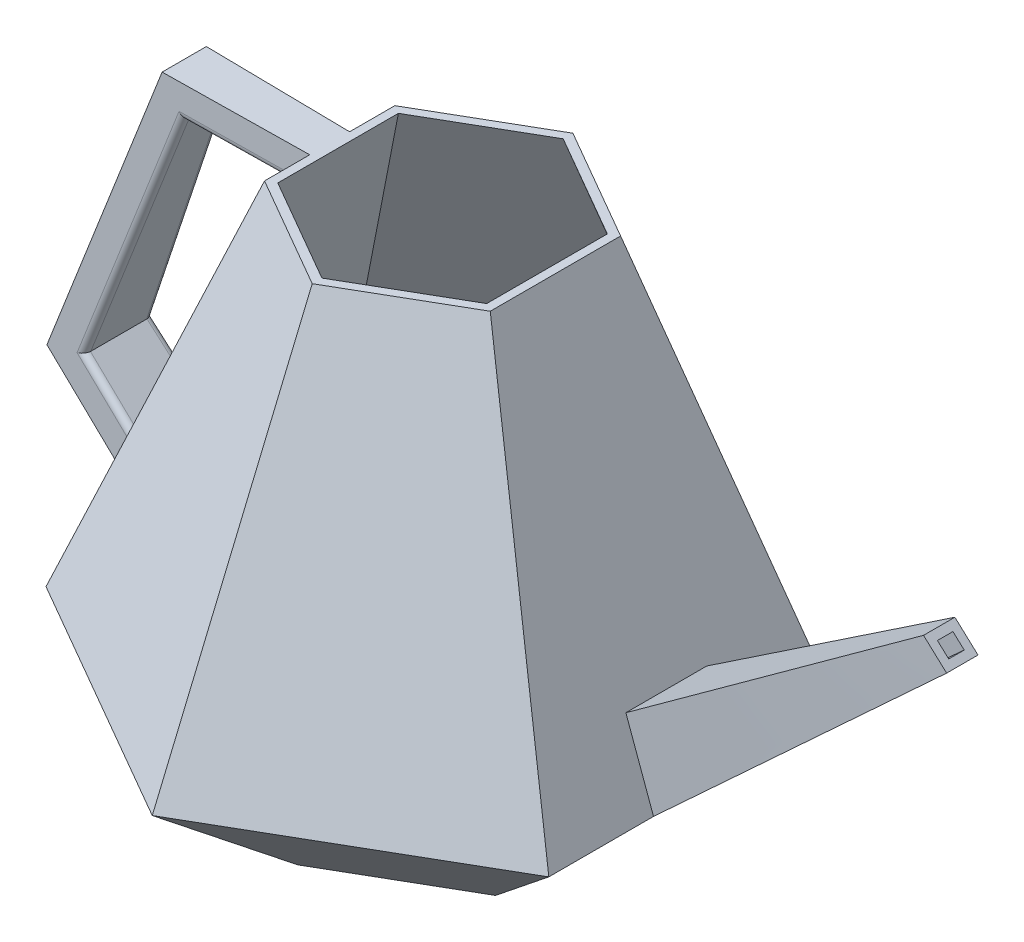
ISO-10303-21;
HEADER;
FILE_DESCRIPTION(('STEP AP214'),'2;1');
FILE_NAME('part.step','',(''),(''),'','','');
FILE_SCHEMA(('AUTOMOTIVE_DESIGN { 1 0 10303 214 1 1 1 1 }'));
ENDSEC;
DATA;
#1=APPLICATION_CONTEXT('core data for automotive mechanical design processes');
#2=APPLICATION_PROTOCOL_DEFINITION('international standard','automotive_design',2000,#1);
#3=PRODUCT_CONTEXT('',#1,'mechanical');
#4=PRODUCT('Part','Part','',(#3));
#5=PRODUCT_RELATED_PRODUCT_CATEGORY('part','',(#4));
#6=PRODUCT_DEFINITION_FORMATION('','',#4);
#7=PRODUCT_DEFINITION_CONTEXT('part definition',#1,'design');
#8=PRODUCT_DEFINITION('design','',#6,#7);
#9=PRODUCT_DEFINITION_SHAPE('','',#8);
#10=(LENGTH_UNIT() NAMED_UNIT(*) SI_UNIT(.MILLI.,.METRE.));
#11=(NAMED_UNIT(*) PLANE_ANGLE_UNIT() SI_UNIT($,.RADIAN.));
#12=(NAMED_UNIT(*) SI_UNIT($,.STERADIAN.) SOLID_ANGLE_UNIT());
#13=UNCERTAINTY_MEASURE_WITH_UNIT(LENGTH_MEASURE(1.E-05),#10,'distance_accuracy_value','');
#14=(GEOMETRIC_REPRESENTATION_CONTEXT(3) GLOBAL_UNCERTAINTY_ASSIGNED_CONTEXT((#13)) GLOBAL_UNIT_ASSIGNED_CONTEXT((#10,
#11,#12)) REPRESENTATION_CONTEXT('',''));
#15=CARTESIAN_POINT('',(0.,0.,0.));
#16=DIRECTION('',(0.,0.,1.));
#17=DIRECTION('',(1.,0.,0.));
#18=AXIS2_PLACEMENT_3D('',#15,#16,#17);
#19=CARTESIAN_POINT('',(0.,0.,0.));
#20=DIRECTION('',(-0.675590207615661,-0.737277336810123,0.));
#21=DIRECTION('',(0.737277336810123,-0.675590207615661,0.));
#22=AXIS2_PLACEMENT_3D('',#19,#20,#21);
#23=PLANE('',#22);
#24=DIRECTION('',(0.,0.,-1.));
#25=VECTOR('',#24,1.);
#26=CARTESIAN_POINT('',(-59.5112453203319,54.5320092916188,9.525));
#27=LINE('',#26,#25);
#28=CARTESIAN_POINT('',(-59.5112453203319,54.5320092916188,8.89921768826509));
#29=VERTEX_POINT('',#28);
#30=CARTESIAN_POINT('',(-59.5112453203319,54.5320092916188,-8.89921768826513));
#31=VERTEX_POINT('',#30);
#32=EDGE_CURVE('E353',#29,#31,#27,.T.);
#33=ORIENTED_EDGE('',*,*,#32,.T.);
#34=DIRECTION('',(0.73717444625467,-0.675495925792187,-0.0167059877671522));
#35=VECTOR('',#34,1.);
#36=CARTESIAN_POINT('',(-0.12620488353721,0.115645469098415,-10.2450127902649));
#37=LINE('',#36,#35);
#38=CARTESIAN_POINT('',(-31.8977491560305,29.2289019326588,-9.525));
#39=VERTEX_POINT('',#38);
#40=EDGE_CURVE('E335',#31,#39,#37,.T.);
#41=ORIENTED_EDGE('',*,*,#40,.T.);
#42=DIRECTION('',(0.,0.,-1.));
#43=VECTOR('',#42,1.);
#44=CARTESIAN_POINT('',(-31.8977491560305,29.2289019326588,36.747045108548));
#45=LINE('',#44,#43);
#46=CARTESIAN_POINT('',(-31.8977491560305,29.2289019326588,-36.747045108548));
#47=VERTEX_POINT('',#46);
#48=EDGE_CURVE('E348',#39,#47,#45,.T.);
#49=ORIENTED_EDGE('',*,*,#48,.T.);
#50=DIRECTION('',(-0.678376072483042,0.621617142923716,-0.391660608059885));
#51=VECTOR('',#50,1.);
#52=CARTESIAN_POINT('',(0.,0.,-18.3308710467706));
#53=LINE('',#52,#51);
#54=CARTESIAN_POINT('',(0.,0.,-18.3308710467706));
#55=VERTEX_POINT('',#54);
#56=EDGE_CURVE('E701',#55,#47,#53,.T.);
#57=ORIENTED_EDGE('',*,*,#56,.F.);
#58=DIRECTION('',(0.,0.,-1.));
#59=VECTOR('',#58,1.);
#60=CARTESIAN_POINT('',(0.,0.,18.3308710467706));
#61=LINE('',#60,#59);
#62=CARTESIAN_POINT('',(0.,0.,18.3308710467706));
#63=VERTEX_POINT('',#62);
#64=EDGE_CURVE('E614',#63,#55,#61,.T.);
#65=ORIENTED_EDGE('',*,*,#64,.F.);
#66=DIRECTION('',(-0.678376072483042,0.621617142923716,0.391660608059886));
#67=VECTOR('',#66,1.);
#68=CARTESIAN_POINT('',(0.,0.,18.3308710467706));
#69=LINE('',#68,#67);
#70=CARTESIAN_POINT('',(-31.8977491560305,29.2289019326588,36.747045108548));
#71=VERTEX_POINT('',#70);
#72=EDGE_CURVE('E624',#63,#71,#69,.T.);
#73=ORIENTED_EDGE('',*,*,#72,.T.);
#74=CARTESIAN_POINT('',(-31.8977491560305,29.2289019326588,9.52499999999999));
#75=VERTEX_POINT('',#74);
#76=EDGE_CURVE('E364',#71,#75,#45,.T.);
#77=ORIENTED_EDGE('',*,*,#76,.T.);
#78=DIRECTION('',(-0.73717444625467,0.675495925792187,-0.0167059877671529));
#79=VECTOR('',#78,1.);
#80=CARTESIAN_POINT('',(-0.126204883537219,0.115645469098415,10.2450127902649));
#81=LINE('',#80,#79);
#82=EDGE_CURVE('E1057',#75,#29,#81,.T.);
#83=ORIENTED_EDGE('',*,*,#82,.T.);
#84=EDGE_LOOP('',(#33,#41,#49,#57,#65,#73,#77,#83));
#85=FACE_BOUND('',#84,.T.);
#86=ADVANCED_FACE('F67',(#85),#23,.T.);
#87=CARTESIAN_POINT('',(0.,125.590488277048,0.));
#88=DIRECTION('',(0.,-1.,0.));
#89=DIRECTION('',(0.,0.,-1.));
#90=AXIS2_PLACEMENT_3D('',#87,#88,#89);
#91=PLANE('',#90);
#92=DIRECTION('',(-0.866025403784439,0.,0.5));
#93=VECTOR('',#92,1.);
#94=CARTESIAN_POINT('',(21.1608222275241,125.590488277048,36.6516192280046));
#95=LINE('',#94,#93);
#96=CARTESIAN_POINT('',(58.1966444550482,125.590488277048,15.2689772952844));
#97=VERTEX_POINT('',#96);
#98=CARTESIAN_POINT('',(31.75,125.590488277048,30.5379545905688));
#99=VERTEX_POINT('',#98);
#100=EDGE_CURVE('E1159',#97,#99,#95,.T.);
#101=ORIENTED_EDGE('',*,*,#100,.T.);
#102=DIRECTION('',(-0.866025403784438,0.,-0.5));
#103=VECTOR('',#102,1.);
#104=CARTESIAN_POINT('',(-5.28582222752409,125.590488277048,9.15531265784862));
#105=LINE('',#104,#103);
#106=CARTESIAN_POINT('',(5.3033555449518,125.590488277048,15.2689772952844));
#107=VERTEX_POINT('',#106);
#108=EDGE_CURVE('E1157',#99,#107,#105,.T.);
#109=ORIENTED_EDGE('',*,*,#108,.T.);
#110=DIRECTION('',(0.,0.,-1.));
#111=VECTOR('',#110,1.);
#112=CARTESIAN_POINT('',(5.30335554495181,125.590488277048,0.));
#113=LINE('',#112,#111);
#114=CARTESIAN_POINT('',(5.30335554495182,125.590488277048,-15.2689772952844));
#115=VERTEX_POINT('',#114);
#116=EDGE_CURVE('E1172',#107,#115,#113,.T.);
#117=ORIENTED_EDGE('',*,*,#116,.T.);
#118=DIRECTION('',(0.866025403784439,0.,-0.5));
#119=VECTOR('',#118,1.);
#120=CARTESIAN_POINT('',(-5.2858222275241,125.590488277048,-9.15531265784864));
#121=LINE('',#120,#119);
#122=CARTESIAN_POINT('',(31.75,125.590488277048,-30.5379545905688));
#123=VERTEX_POINT('',#122);
#124=EDGE_CURVE('E1169',#115,#123,#121,.T.);
#125=ORIENTED_EDGE('',*,*,#124,.T.);
#126=DIRECTION('',(0.866025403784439,0.,0.5));
#127=VECTOR('',#126,1.);
#128=CARTESIAN_POINT('',(21.1608222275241,125.590488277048,-36.6516192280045));
#129=LINE('',#128,#127);
#130=CARTESIAN_POINT('',(58.1966444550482,125.590488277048,-15.2689772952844));
#131=VERTEX_POINT('',#130);
#132=EDGE_CURVE('E1166',#123,#131,#129,.T.);
#133=ORIENTED_EDGE('',*,*,#132,.T.);
#134=DIRECTION('',(0.,0.,1.));
#135=VECTOR('',#134,1.);
#136=CARTESIAN_POINT('',(58.1966444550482,125.590488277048,0.));
#137=LINE('',#136,#135);
#138=EDGE_CURVE('E1163',#131,#97,#137,.T.);
#139=ORIENTED_EDGE('',*,*,#138,.T.);
#140=EDGE_LOOP('',(#101,#109,#117,#125,#133,#139));
#141=FACE_BOUND('',#140,.T.);
#142=DIRECTION('',(0.999888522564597,0.,0.0149312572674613));
#143=VECTOR('',#142,1.);
#144=CARTESIAN_POINT('',(0.0760687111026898,125.590488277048,-5.09402723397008));
#145=LINE('',#144,#143);
#146=CARTESIAN_POINT('',(-33.648074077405,125.590488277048,-5.59762722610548));
#147=VERTEX_POINT('',#146);
#148=CARTESIAN_POINT('',(3.17499999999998,125.590488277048,-5.04775113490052));
#149=VERTEX_POINT('',#148);
#150=EDGE_CURVE('E355',#147,#149,#145,.T.);
#151=ORIENTED_EDGE('',*,*,#150,.F.);
#152=DIRECTION('',(0.,0.,-1.));
#153=VECTOR('',#152,1.);
#154=CARTESIAN_POINT('',(-33.648074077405,125.590488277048,9.525));
#155=LINE('',#154,#153);
#156=CARTESIAN_POINT('',(-33.648074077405,125.590488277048,5.59762722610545));
#157=VERTEX_POINT('',#156);
#158=EDGE_CURVE('E1071',#157,#147,#155,.T.);
#159=ORIENTED_EDGE('',*,*,#158,.F.);
#160=DIRECTION('',(-0.999888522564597,0.,0.0149312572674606));
#161=VECTOR('',#160,1.);
#162=CARTESIAN_POINT('',(0.0760687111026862,125.590488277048,5.09402723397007));
#163=LINE('',#162,#161);
#164=CARTESIAN_POINT('',(3.17499999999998,125.590488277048,5.04775113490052));
#165=VERTEX_POINT('',#164);
#166=EDGE_CURVE('E1059',#165,#157,#163,.T.);
#167=ORIENTED_EDGE('',*,*,#166,.F.);
#168=DIRECTION('',(0.,0.,-1.));
#169=VECTOR('',#168,1.);
#170=CARTESIAN_POINT('',(3.17499999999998,125.590488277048,5.04775113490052));
#171=LINE('',#170,#169);
#172=CARTESIAN_POINT('',(3.17499999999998,125.590488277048,9.525));
#173=VERTEX_POINT('',#172);
#174=EDGE_CURVE('E1025',#173,#165,#171,.T.);
#175=ORIENTED_EDGE('',*,*,#174,.F.);
#176=DIRECTION('',(0.,0.,-1.));
#177=VECTOR('',#176,1.);
#178=CARTESIAN_POINT('',(3.17499999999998,125.590488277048,16.4977839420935));
#179=LINE('',#178,#177);
#180=CARTESIAN_POINT('',(3.17499999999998,125.590488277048,16.4977839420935));
#181=VERTEX_POINT('',#180);
#182=EDGE_CURVE('E1042',#181,#173,#179,.T.);
#183=ORIENTED_EDGE('',*,*,#182,.F.);
#184=DIRECTION('',(-0.866025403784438,0.,-0.5));
#185=VECTOR('',#184,1.);
#186=CARTESIAN_POINT('',(31.75,125.590488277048,32.9955678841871));
#187=LINE('',#186,#185);
#188=CARTESIAN_POINT('',(31.75,125.590488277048,32.9955678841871));
#189=VERTEX_POINT('',#188);
#190=EDGE_CURVE('E907',#189,#181,#187,.T.);
#191=ORIENTED_EDGE('',*,*,#190,.F.);
#192=DIRECTION('',(-0.866025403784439,0.,0.5));
#193=VECTOR('',#192,1.);
#194=CARTESIAN_POINT('',(60.325,125.590488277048,16.4977839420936));
#195=LINE('',#194,#193);
#196=CARTESIAN_POINT('',(60.325,125.590488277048,16.4977839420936));
#197=VERTEX_POINT('',#196);
#198=EDGE_CURVE('E942',#197,#189,#195,.T.);
#199=ORIENTED_EDGE('',*,*,#198,.F.);
#200=DIRECTION('',(0.,0.,1.));
#201=VECTOR('',#200,1.);
#202=CARTESIAN_POINT('',(60.325,125.590488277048,-16.4977839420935));
#203=LINE('',#202,#201);
#204=CARTESIAN_POINT('',(60.325,125.590488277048,-16.4977839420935));
#205=VERTEX_POINT('',#204);
#206=EDGE_CURVE('E1313',#205,#197,#203,.T.);
#207=ORIENTED_EDGE('',*,*,#206,.F.);
#208=DIRECTION('',(0.866025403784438,0.,0.5));
#209=VECTOR('',#208,1.);
#210=CARTESIAN_POINT('',(31.75,125.590488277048,-32.9955678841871));
#211=LINE('',#210,#209);
#212=CARTESIAN_POINT('',(31.75,125.590488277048,-32.9955678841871));
#213=VERTEX_POINT('',#212);
#214=EDGE_CURVE('E436',#213,#205,#211,.T.);
#215=ORIENTED_EDGE('',*,*,#214,.F.);
#216=DIRECTION('',(0.866025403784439,0.,-0.5));
#217=VECTOR('',#216,1.);
#218=CARTESIAN_POINT('',(3.17499999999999,125.590488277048,-16.4977839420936));
#219=LINE('',#218,#217);
#220=CARTESIAN_POINT('',(3.17499999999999,125.590488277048,-16.4977839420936));
#221=VERTEX_POINT('',#220);
#222=EDGE_CURVE('E418',#221,#213,#219,.T.);
#223=ORIENTED_EDGE('',*,*,#222,.F.);
#224=CARTESIAN_POINT('',(3.17499999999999,125.590488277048,-9.525));
#225=VERTEX_POINT('',#224);
#226=EDGE_CURVE('E1039',#225,#221,#179,.T.);
#227=ORIENTED_EDGE('',*,*,#226,.F.);
#228=DIRECTION('',(0.,0.,-1.));
#229=VECTOR('',#228,1.);
#230=CARTESIAN_POINT('',(3.17499999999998,125.590488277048,-5.04775113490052));
#231=LINE('',#230,#229);
#232=EDGE_CURVE('E342',#149,#225,#231,.T.);
#233=ORIENTED_EDGE('',*,*,#232,.F.);
#234=EDGE_LOOP('',(#151,#159,#167,#175,#183,#191,#199,#207,#215,#223,#227,#233));
#235=FACE_BOUND('',#234,.T.);
#236=ADVANCED_FACE('F974',(#141,#235),#91,.F.);
#237=CARTESIAN_POINT('',(-62.617191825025,22.7907939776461,9.525));
#238=DIRECTION('',(-0.939692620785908,0.342020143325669,0.));
#239=DIRECTION('',(-0.342020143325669,-0.939692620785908,0.));
#240=AXIS2_PLACEMENT_3D('',#237,#238,#239);
#241=PLANE('',#240);
#242=DIRECTION('',(0.,0.,-1.));
#243=VECTOR('',#242,1.);
#244=CARTESIAN_POINT('',(-50.2384738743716,56.8010420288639,9.525));
#245=LINE('',#244,#243);
#246=CARTESIAN_POINT('',(-50.2384738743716,56.8010420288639,7.07864215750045));
#247=VERTEX_POINT('',#246);
#248=CARTESIAN_POINT('',(-50.2384738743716,56.8010420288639,-7.07864215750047));
#249=VERTEX_POINT('',#248);
#250=EDGE_CURVE('E1058',#247,#249,#245,.T.);
#251=ORIENTED_EDGE('',*,*,#250,.T.);
#252=DIRECTION('',(-0.341694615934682,-0.938798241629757,-0.0436193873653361));
#253=VECTOR('',#252,1.);
#254=CARTESIAN_POINT('',(-28.113860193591,117.587918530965,-4.25430121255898));
#255=LINE('',#254,#253);
#256=CARTESIAN_POINT('',(-28.089691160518,117.654322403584,-4.25121588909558));
#257=VERTEX_POINT('',#256);
#258=EDGE_CURVE('E1250',#249,#257,#255,.F.);
#259=ORIENTED_EDGE('',*,*,#258,.T.);
#260=CARTESIAN_POINT('',(-27.5123739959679,119.240488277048,-4.17751785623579));
#261=DIRECTION('',(-0.939692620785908,0.342020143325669,0.));
#262=DIRECTION('',(0.341694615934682,0.938798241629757,0.0436193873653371));
#263=AXIS2_PLACEMENT_3D('',#260,#261,#262);
#264=ELLIPSE('',#263,1.68957056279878,1.5875);
#265=CARTESIAN_POINT('',(-28.0901767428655,117.652988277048,-4.18614613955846));
#266=VERTEX_POINT('',#265);
#267=EDGE_CURVE('E1260',#257,#266,#264,.T.);
#268=ORIENTED_EDGE('',*,*,#267,.T.);
#269=DIRECTION('',(0.,0.,-1.));
#270=VECTOR('',#269,1.);
#271=CARTESIAN_POINT('',(-28.0901767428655,117.652988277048,9.525));
#272=LINE('',#271,#270);
#273=CARTESIAN_POINT('',(-28.0901767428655,117.652988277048,4.18614613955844));
#274=VERTEX_POINT('',#273);
#275=EDGE_CURVE('E1077',#274,#266,#272,.T.);
#276=ORIENTED_EDGE('',*,*,#275,.F.);
#277=CARTESIAN_POINT('',(-27.5123739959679,119.240488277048,4.17751785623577));
#278=DIRECTION('',(-0.939692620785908,0.342020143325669,0.));
#279=DIRECTION('',(-0.341694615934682,-0.938798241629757,0.0436193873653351));
#280=AXIS2_PLACEMENT_3D('',#277,#278,#279);
#281=ELLIPSE('',#280,1.68957056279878,1.5875);
#282=CARTESIAN_POINT('',(-28.089691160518,117.654322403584,4.25121588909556));
#283=VERTEX_POINT('',#282);
#284=EDGE_CURVE('E1275',#274,#283,#281,.T.);
#285=ORIENTED_EDGE('',*,*,#284,.T.);
#286=DIRECTION('',(0.341694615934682,0.938798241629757,-0.0436193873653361));
#287=VECTOR('',#286,1.);
#288=CARTESIAN_POINT('',(-50.2621573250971,56.7359722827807,7.08166549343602));
#289=LINE('',#288,#287);
#290=EDGE_CURVE('E84',#283,#247,#289,.F.);
#291=ORIENTED_EDGE('',*,*,#290,.T.);
#292=EDGE_LOOP('',(#251,#259,#268,#276,#285,#291));
#293=FACE_BOUND('',#292,.T.);
#294=ADVANCED_FACE('F778',(#293),#241,.F.);
#295=CARTESIAN_POINT('',(0.,117.652988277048,9.525));
#296=DIRECTION('',(0.,1.,0.));
#297=DIRECTION('',(0.,0.,1.));
#298=AXIS2_PLACEMENT_3D('',#295,#296,#297);
#299=PLANE('',#298);
#300=ORIENTED_EDGE('',*,*,#275,.T.);
#301=DIRECTION('',(-0.999888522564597,0.,-0.0149312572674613));
#302=VECTOR('',#301,1.);
#303=CARTESIAN_POINT('',(0.261290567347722,117.652988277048,-3.76277589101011));
#304=LINE('',#303,#302);
#305=CARTESIAN_POINT('',(0.285986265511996,117.652988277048,-3.76240711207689));
#306=VERTEX_POINT('',#305);
#307=EDGE_CURVE('E1015',#266,#306,#304,.F.);
#308=ORIENTED_EDGE('',*,*,#307,.T.);
#309=DIRECTION('',(0.,0.,-1.));
#310=VECTOR('',#309,1.);
#311=CARTESIAN_POINT('',(0.285986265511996,117.652988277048,9.525));
#312=LINE('',#311,#310);
#313=CARTESIAN_POINT('',(0.285986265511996,117.652988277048,3.76240711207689));
#314=VERTEX_POINT('',#313);
#315=EDGE_CURVE('E1074',#314,#306,#312,.T.);
#316=ORIENTED_EDGE('',*,*,#315,.F.);
#317=DIRECTION('',(0.999888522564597,0.,-0.0149312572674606));
#318=VECTOR('',#317,1.);
#319=CARTESIAN_POINT('',(-28.1148724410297,117.652988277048,4.18651491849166));
#320=LINE('',#319,#318);
#321=EDGE_CURVE('E1013',#314,#274,#320,.F.);
#322=ORIENTED_EDGE('',*,*,#321,.T.);
#323=EDGE_LOOP('',(#300,#308,#316,#322));
#324=FACE_BOUND('',#323,.T.);
#325=ADVANCED_FACE('F1241',(#324),#299,.F.);
#326=CARTESIAN_POINT('',(-70.0760020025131,25.5055788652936,9.525));
#327=DIRECTION('',(-0.939692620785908,0.342020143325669,0.));
#328=DIRECTION('',(-0.342020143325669,-0.939692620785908,0.));
#329=AXIS2_PLACEMENT_3D('',#326,#327,#328);
#330=PLANE('',#329);
#331=ORIENTED_EDGE('',*,*,#158,.T.);
#332=DIRECTION('',(-0.341694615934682,-0.938798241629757,-0.0436193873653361));
#333=VECTOR('',#332,1.);
#334=CARTESIAN_POINT('',(-69.7812970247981,26.3152741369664,-10.2102519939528));
#335=LINE('',#334,#333);
#336=EDGE_CURVE('E1031',#147,#31,#335,.T.);
#337=ORIENTED_EDGE('',*,*,#336,.T.);
#338=ORIENTED_EDGE('',*,*,#32,.F.);
#339=DIRECTION('',(0.341694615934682,0.938798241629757,-0.0436193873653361));
#340=VECTOR('',#339,1.);
#341=CARTESIAN_POINT('',(-70.0652279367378,25.5351803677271,10.2464974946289));
#342=LINE('',#341,#340);
#343=EDGE_CURVE('E354',#29,#157,#342,.T.);
#344=ORIENTED_EDGE('',*,*,#343,.T.);
#345=EDGE_LOOP('',(#331,#337,#338,#344));
#346=FACE_BOUND('',#345,.T.);
#347=ADVANCED_FACE('F1246',(#346),#330,.T.);
#348=CARTESIAN_POINT('',(5.36249727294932,5.85213886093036,9.525));
#349=DIRECTION('',(-0.675590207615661,-0.737277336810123,0.));
#350=DIRECTION('',(0.737277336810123,-0.675590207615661,0.));
#351=AXIS2_PLACEMENT_3D('',#348,#349,#350);
#352=PLANE('',#351);
#353=DIRECTION('',(0.,0.,-1.));
#354=VECTOR('',#353,1.);
#355=CARTESIAN_POINT('',(-28.9592871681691,37.3022598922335,9.525));
#356=LINE('',#355,#354);
#357=CARTESIAN_POINT('',(-28.9592871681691,37.3022598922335,7.62491084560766));
#358=VERTEX_POINT('',#357);
#359=CARTESIAN_POINT('',(-28.9592871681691,37.3022598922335,-7.62491084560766));
#360=VERTEX_POINT('',#359);
#361=EDGE_CURVE('E1062',#358,#360,#356,.T.);
#362=ORIENTED_EDGE('',*,*,#361,.T.);
#363=DIRECTION('',(0.73717444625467,-0.675495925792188,-0.0167059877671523));
#364=VECTOR('',#363,1.);
#365=CARTESIAN_POINT('',(-50.2196934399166,56.7838329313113,-7.14310346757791));
#366=LINE('',#365,#364);
#367=CARTESIAN_POINT('',(-50.2395029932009,56.801985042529,-7.14265453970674));
#368=VERTEX_POINT('',#367);
#369=EDGE_CURVE('E1018',#360,#368,#366,.F.);
#370=ORIENTED_EDGE('',*,*,#369,.T.);
#371=CARTESIAN_POINT('',(-51.5053357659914,57.9619070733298,-7.04993229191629));
#372=DIRECTION('',(-0.675590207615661,-0.737277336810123,0.));
#373=DIRECTION('',(-0.732525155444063,0.671235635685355,0.113356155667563));
#374=AXIS2_PLACEMENT_3D('',#371,#372,#373);
#375=ELLIPSE('',#374,1.71993461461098,1.5875);
#376=EDGE_CURVE('E76',#368,#249,#375,.T.);
#377=ORIENTED_EDGE('',*,*,#376,.T.);
#378=ORIENTED_EDGE('',*,*,#250,.F.);
#379=CARTESIAN_POINT('',(-51.5053357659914,57.9619070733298,7.04993229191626));
#380=DIRECTION('',(-0.675590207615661,-0.737277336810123,0.));
#381=DIRECTION('',(0.732525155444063,-0.671235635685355,0.113356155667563));
#382=AXIS2_PLACEMENT_3D('',#379,#380,#381);
#383=ELLIPSE('',#382,1.71993461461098,1.5875);
#384=CARTESIAN_POINT('',(-50.2395029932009,56.801985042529,7.14265453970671));
#385=VERTEX_POINT('',#384);
#386=EDGE_CURVE('E12',#247,#385,#383,.T.);
#387=ORIENTED_EDGE('',*,*,#386,.T.);
#388=DIRECTION('',(-0.73717444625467,0.675495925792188,-0.0167059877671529));
#389=VECTOR('',#388,1.);
#390=CARTESIAN_POINT('',(-28.9405067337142,37.2850507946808,7.62533645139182));
#391=LINE('',#390,#389);
#392=EDGE_CURVE('E92',#385,#358,#391,.F.);
#393=ORIENTED_EDGE('',*,*,#392,.T.);
#394=EDGE_LOOP('',(#362,#370,#377,#378,#387,#393));
#395=FACE_BOUND('',#394,.T.);
#396=ADVANCED_FACE('F573',(#395),#352,.F.);
#397=CARTESIAN_POINT('',(0.,0.,0.));
#398=DIRECTION('',(0.,-1.,0.));
#399=DIRECTION('',(1.,0.,0.));
#400=AXIS2_PLACEMENT_3D('',#397,#398,#399);
#401=PLANE('',#400);
#402=DIRECTION('',(0.,0.,1.));
#403=VECTOR('',#402,1.);
#404=CARTESIAN_POINT('',(63.5,0.,-18.3308710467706));
#405=LINE('',#404,#403);
#406=CARTESIAN_POINT('',(63.5,0.,-18.3308710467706));
#407=VERTEX_POINT('',#406);
#408=CARTESIAN_POINT('',(63.5,0.,18.3308710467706));
#409=VERTEX_POINT('',#408);
#410=EDGE_CURVE('E609',#407,#409,#405,.T.);
#411=ORIENTED_EDGE('',*,*,#410,.T.);
#412=DIRECTION('',(-0.866025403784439,0.,0.5));
#413=VECTOR('',#412,1.);
#414=CARTESIAN_POINT('',(63.5,0.,18.3308710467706));
#415=LINE('',#414,#413);
#416=CARTESIAN_POINT('',(31.75,0.,36.6617420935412));
#417=VERTEX_POINT('',#416);
#418=EDGE_CURVE('E601',#409,#417,#415,.T.);
#419=ORIENTED_EDGE('',*,*,#418,.T.);
#420=DIRECTION('',(-0.866025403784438,0.,-0.500000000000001));
#421=VECTOR('',#420,1.);
#422=CARTESIAN_POINT('',(31.75,0.,36.6617420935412));
#423=LINE('',#422,#421);
#424=EDGE_CURVE('E608',#417,#63,#423,.T.);
#425=ORIENTED_EDGE('',*,*,#424,.T.);
#426=ORIENTED_EDGE('',*,*,#64,.T.);
#427=DIRECTION('',(0.866025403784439,0.,-0.5));
#428=VECTOR('',#427,1.);
#429=CARTESIAN_POINT('',(0.,0.,-18.3308710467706));
#430=LINE('',#429,#428);
#431=CARTESIAN_POINT('',(31.75,0.,-36.6617420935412));
#432=VERTEX_POINT('',#431);
#433=EDGE_CURVE('E553',#55,#432,#430,.T.);
#434=ORIENTED_EDGE('',*,*,#433,.T.);
#435=DIRECTION('',(0.866025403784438,0.,0.5));
#436=VECTOR('',#435,1.);
#437=CARTESIAN_POINT('',(31.75,0.,-36.6617420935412));
#438=LINE('',#437,#436);
#439=EDGE_CURVE('E549',#432,#407,#438,.T.);
#440=ORIENTED_EDGE('',*,*,#439,.T.);
#441=EDGE_LOOP('',(#411,#419,#425,#426,#434,#440));
#442=FACE_BOUND('',#441,.T.);
#443=ADVANCED_FACE('F564',(#442),#401,.T.);
#444=CARTESIAN_POINT('',(10.8685519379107,-23.7218862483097,18.8248841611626));
#445=DIRECTION('',(0.337795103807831,-0.737277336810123,0.585078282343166));
#446=DIRECTION('',(0.,-0.621617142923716,-0.78332121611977));
#447=AXIS2_PLACEMENT_3D('',#444,#445,#446);
#448=PLANE('',#447);
#449=DIRECTION('',(0.678376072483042,0.621617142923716,0.391660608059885));
#450=VECTOR('',#449,1.);
#451=CARTESIAN_POINT('',(63.5,0.,18.3308710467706));
#452=LINE('',#451,#450);
#453=CARTESIAN_POINT('',(95.3977491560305,29.2289019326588,36.747045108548));
#454=VERTEX_POINT('',#453);
#455=EDGE_CURVE('E552',#409,#454,#452,.T.);
#456=ORIENTED_EDGE('',*,*,#455,.T.);
#457=DIRECTION('',(-0.866025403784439,0.,0.5));
#458=VECTOR('',#457,1.);
#459=CARTESIAN_POINT('',(95.3977491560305,29.2289019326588,36.747045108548));
#460=LINE('',#459,#458);
#461=CARTESIAN_POINT('',(31.75,29.2289019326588,73.4940902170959));
#462=VERTEX_POINT('',#461);
#463=EDGE_CURVE('E632',#454,#462,#460,.T.);
#464=ORIENTED_EDGE('',*,*,#463,.T.);
#465=DIRECTION('',(0.,0.621617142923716,0.78332121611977));
#466=VECTOR('',#465,1.);
#467=CARTESIAN_POINT('',(31.75,0.,36.6617420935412));
#468=LINE('',#467,#466);
#469=EDGE_CURVE('E622',#417,#462,#468,.T.);
#470=ORIENTED_EDGE('',*,*,#469,.F.);
#471=ORIENTED_EDGE('',*,*,#418,.F.);
#472=EDGE_LOOP('',(#456,#464,#470,#471));
#473=FACE_BOUND('',#472,.T.);
#474=ADVANCED_FACE('F572',(#473),#448,.T.);
#475=CARTESIAN_POINT('',(-3.62285064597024,-7.90729541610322,6.27496138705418));
#476=DIRECTION('',(-0.337795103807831,-0.737277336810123,0.585078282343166));
#477=DIRECTION('',(0.,-0.621617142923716,-0.783321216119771));
#478=AXIS2_PLACEMENT_3D('',#475,#476,#477);
#479=PLANE('',#478);
#480=ORIENTED_EDGE('',*,*,#469,.T.);
#481=DIRECTION('',(-0.866025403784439,0.,-0.5));
#482=VECTOR('',#481,1.);
#483=CARTESIAN_POINT('',(31.75,29.2289019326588,73.4940902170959));
#484=LINE('',#483,#482);
#485=EDGE_CURVE('E365',#462,#71,#484,.T.);
#486=ORIENTED_EDGE('',*,*,#485,.T.);
#487=ORIENTED_EDGE('',*,*,#72,.F.);
#488=ORIENTED_EDGE('',*,*,#424,.F.);
#489=EDGE_LOOP('',(#480,#486,#487,#488));
#490=FACE_BOUND('',#489,.T.);
#491=ADVANCED_FACE('F521',(#490),#479,.T.);
#492=CARTESIAN_POINT('',(28.9828051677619,-31.6291816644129,0.));
#493=DIRECTION('',(0.675590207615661,-0.737277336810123,0.));
#494=DIRECTION('',(0.737277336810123,0.675590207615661,0.));
#495=AXIS2_PLACEMENT_3D('',#492,#493,#494);
#496=PLANE('',#495);
#497=DIRECTION('',(0.678376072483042,0.621617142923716,-0.391660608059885));
#498=VECTOR('',#497,1.);
#499=CARTESIAN_POINT('',(63.5,0.,-18.3308710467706));
#500=LINE('',#499,#498);
#501=CARTESIAN_POINT('',(95.3977491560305,29.2289019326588,-36.747045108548));
#502=VERTEX_POINT('',#501);
#503=EDGE_CURVE('E634',#407,#502,#500,.T.);
#504=ORIENTED_EDGE('',*,*,#503,.T.);
#505=DIRECTION('',(0.,0.,1.));
#506=VECTOR('',#505,1.);
#507=CARTESIAN_POINT('',(95.3977491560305,29.2289019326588,-36.747045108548));
#508=LINE('',#507,#506);
#509=CARTESIAN_POINT('',(95.3977491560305,29.2289019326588,-10.2375758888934));
#510=VERTEX_POINT('',#509);
#511=EDGE_CURVE('E471',#502,#510,#508,.T.);
#512=ORIENTED_EDGE('',*,*,#511,.T.);
#513=DIRECTION('',(0.735577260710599,0.674032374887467,0.0678708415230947));
#514=VECTOR('',#513,1.);
#515=CARTESIAN_POINT('',(95.3977491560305,29.2289019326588,-10.2375758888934));
#516=LINE('',#515,#514);
#517=CARTESIAN_POINT('',(163.338645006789,91.4852627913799,-3.96875));
#518=VERTEX_POINT('',#517);
#519=EDGE_CURVE('E733',#510,#518,#516,.T.);
#520=ORIENTED_EDGE('',*,*,#519,.T.);
#521=DIRECTION('',(0.,0.,1.));
#522=VECTOR('',#521,1.);
#523=CARTESIAN_POINT('',(163.338645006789,91.4852627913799,3.96875));
#524=LINE('',#523,#522);
#525=CARTESIAN_POINT('',(163.338645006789,91.4852627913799,3.96875));
#526=VERTEX_POINT('',#525);
#527=EDGE_CURVE('E503',#518,#526,#524,.T.);
#528=ORIENTED_EDGE('',*,*,#527,.T.);
#529=DIRECTION('',(0.735577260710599,0.674032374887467,-0.067870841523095));
#530=VECTOR('',#529,1.);
#531=CARTESIAN_POINT('',(95.3977491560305,29.2289019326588,10.2375758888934));
#532=LINE('',#531,#530);
#533=CARTESIAN_POINT('',(95.3977491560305,29.2289019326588,10.2375758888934));
#534=VERTEX_POINT('',#533);
#535=EDGE_CURVE('E736',#534,#526,#532,.T.);
#536=ORIENTED_EDGE('',*,*,#535,.F.);
#537=EDGE_CURVE('E489',#534,#454,#508,.T.);
#538=ORIENTED_EDGE('',*,*,#537,.T.);
#539=ORIENTED_EDGE('',*,*,#455,.F.);
#540=ORIENTED_EDGE('',*,*,#410,.F.);
#541=EDGE_LOOP('',(#504,#512,#520,#528,#536,#538,#539,#540));
#542=FACE_BOUND('',#541,.T.);
#543=ADVANCED_FACE('F510',(#542),#496,.T.);
#544=CARTESIAN_POINT('',(10.8685519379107,-23.7218862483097,-18.8248841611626));
#545=DIRECTION('',(0.337795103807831,-0.737277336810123,-0.585078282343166));
#546=DIRECTION('',(0.,0.621617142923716,-0.78332121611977));
#547=AXIS2_PLACEMENT_3D('',#544,#545,#546);
#548=PLANE('',#547);
#549=DIRECTION('',(0.,0.621617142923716,-0.78332121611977));
#550=VECTOR('',#549,1.);
#551=CARTESIAN_POINT('',(31.75,0.,-36.6617420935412));
#552=LINE('',#551,#550);
#553=CARTESIAN_POINT('',(31.75,29.2289019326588,-73.4940902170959));
#554=VERTEX_POINT('',#553);
#555=EDGE_CURVE('E637',#432,#554,#552,.T.);
#556=ORIENTED_EDGE('',*,*,#555,.T.);
#557=DIRECTION('',(0.866025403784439,0.,0.5));
#558=VECTOR('',#557,1.);
#559=CARTESIAN_POINT('',(31.75,29.2289019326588,-73.4940902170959));
#560=LINE('',#559,#558);
#561=EDGE_CURVE('E662',#554,#502,#560,.T.);
#562=ORIENTED_EDGE('',*,*,#561,.T.);
#563=ORIENTED_EDGE('',*,*,#503,.F.);
#564=ORIENTED_EDGE('',*,*,#439,.F.);
#565=EDGE_LOOP('',(#556,#562,#563,#564));
#566=FACE_BOUND('',#565,.T.);
#567=ADVANCED_FACE('F520',(#566),#548,.T.);
#568=CARTESIAN_POINT('',(-3.62285064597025,-7.90729541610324,-6.2749613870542));
#569=DIRECTION('',(-0.337795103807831,-0.737277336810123,-0.585078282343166));
#570=DIRECTION('',(0.,0.621617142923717,-0.78332121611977));
#571=AXIS2_PLACEMENT_3D('',#568,#569,#570);
#572=PLANE('',#571);
#573=ORIENTED_EDGE('',*,*,#56,.T.);
#574=DIRECTION('',(0.866025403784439,0.,-0.5));
#575=VECTOR('',#574,1.);
#576=CARTESIAN_POINT('',(-31.8977491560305,29.2289019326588,-36.747045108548));
#577=LINE('',#576,#575);
#578=EDGE_CURVE('E665',#47,#554,#577,.T.);
#579=ORIENTED_EDGE('',*,*,#578,.T.);
#580=ORIENTED_EDGE('',*,*,#555,.F.);
#581=ORIENTED_EDGE('',*,*,#433,.F.);
#582=EDGE_LOOP('',(#573,#579,#580,#581));
#583=FACE_BOUND('',#582,.T.);
#584=ADVANCED_FACE('F682',(#583),#572,.T.);
#585=CARTESIAN_POINT('',(-25.7891935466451,18.7729976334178,44.6681935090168));
#586=DIRECTION('',(0.469846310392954,-0.34202014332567,-0.813797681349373));
#587=DIRECTION('',(-0.866025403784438,0.,-0.5));
#588=AXIS2_PLACEMENT_3D('',#585,#586,#587);
#589=PLANE('',#588);
#590=DIRECTION('',(-0.335540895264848,-0.921891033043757,0.193724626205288));
#591=VECTOR('',#590,1.);
#592=CARTESIAN_POINT('',(3.17499999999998,125.590488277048,16.4977839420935));
#593=LINE('',#592,#591);
#594=EDGE_CURVE('E956',#181,#71,#593,.T.);
#595=ORIENTED_EDGE('',*,*,#594,.T.);
#596=ORIENTED_EDGE('',*,*,#485,.F.);
#597=DIRECTION('',(0.,-0.921891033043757,0.387449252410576));
#598=VECTOR('',#597,1.);
#599=CARTESIAN_POINT('',(31.75,125.590488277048,32.9955678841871));
#600=LINE('',#599,#598);
#601=EDGE_CURVE('E411',#189,#462,#600,.T.);
#602=ORIENTED_EDGE('',*,*,#601,.F.);
#603=ORIENTED_EDGE('',*,*,#190,.T.);
#604=EDGE_LOOP('',(#595,#596,#602,#603));
#605=FACE_BOUND('',#604,.T.);
#606=ADVANCED_FACE('F691',(#605),#589,.F.);
#607=CARTESIAN_POINT('',(39.807171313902,28.9772509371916,68.9480432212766));
#608=DIRECTION('',(-0.469846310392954,-0.34202014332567,-0.813797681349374));
#609=DIRECTION('',(-0.866025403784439,0.,0.5));
#610=AXIS2_PLACEMENT_3D('',#607,#608,#609);
#611=PLANE('',#610);
#612=ORIENTED_EDGE('',*,*,#601,.T.);
#613=ORIENTED_EDGE('',*,*,#463,.F.);
#614=DIRECTION('',(0.335540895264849,-0.921891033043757,0.193724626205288));
#615=VECTOR('',#614,1.);
#616=CARTESIAN_POINT('',(60.325,125.590488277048,16.4977839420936));
#617=LINE('',#616,#615);
#618=EDGE_CURVE('E657',#197,#454,#617,.T.);
#619=ORIENTED_EDGE('',*,*,#618,.F.);
#620=ORIENTED_EDGE('',*,*,#198,.T.);
#621=EDGE_LOOP('',(#612,#613,#619,#620));
#622=FACE_BOUND('',#621,.T.);
#623=ADVANCED_FACE('F391',(#622),#611,.F.);
#624=CARTESIAN_POINT('',(-37.5604093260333,13.6708709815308,0.));
#625=DIRECTION('',(0.939692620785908,-0.342020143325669,0.));
#626=DIRECTION('',(0.342020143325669,0.939692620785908,0.));
#627=AXIS2_PLACEMENT_3D('',#624,#625,#626);
#628=PLANE('',#627);
#629=DIRECTION('',(-0.341694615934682,-0.938798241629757,0.0436193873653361));
#630=VECTOR('',#629,1.);
#631=CARTESIAN_POINT('',(-31.8977491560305,29.2289019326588,9.52499999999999));
#632=LINE('',#631,#630);
#633=CARTESIAN_POINT('',(0.887472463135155,119.305558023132,5.33976788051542));
#634=VERTEX_POINT('',#633);
#635=EDGE_CURVE('E1024',#165,#634,#632,.T.);
#636=ORIENTED_EDGE('',*,*,#635,.T.);
#637=CARTESIAN_POINT('',(0.863789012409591,119.240488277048,3.75377882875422));
#638=DIRECTION('',(0.939692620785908,-0.342020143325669,0.));
#639=DIRECTION('',(-0.341694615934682,-0.938798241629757,0.0436193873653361));
#640=AXIS2_PLACEMENT_3D('',#637,#638,#639);
#641=ELLIPSE('',#640,1.68957056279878,1.5875);
#642=EDGE_CURVE('E1273',#634,#314,#641,.T.);
#643=ORIENTED_EDGE('',*,*,#642,.T.);
#644=ORIENTED_EDGE('',*,*,#315,.T.);
#645=CARTESIAN_POINT('',(0.863789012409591,119.240488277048,-3.75377882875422));
#646=DIRECTION('',(0.939692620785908,-0.342020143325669,0.));
#647=DIRECTION('',(0.341694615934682,0.938798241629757,0.0436193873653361));
#648=AXIS2_PLACEMENT_3D('',#645,#646,#647);
#649=ELLIPSE('',#648,1.68957056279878,1.5875);
#650=CARTESIAN_POINT('',(0.887472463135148,119.305558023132,-5.33976788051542));
#651=VERTEX_POINT('',#650);
#652=EDGE_CURVE('E1262',#306,#651,#649,.T.);
#653=ORIENTED_EDGE('',*,*,#652,.T.);
#654=DIRECTION('',(0.341694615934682,0.938798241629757,0.0436193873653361));
#655=VECTOR('',#654,1.);
#656=CARTESIAN_POINT('',(-31.8977491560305,29.2289019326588,-9.525));
#657=LINE('',#656,#655);
#658=EDGE_CURVE('E343',#651,#149,#657,.T.);
#659=ORIENTED_EDGE('',*,*,#658,.T.);
#660=ORIENTED_EDGE('',*,*,#232,.T.);
#661=ORIENTED_EDGE('',*,*,#226,.T.);
#662=DIRECTION('',(-0.335540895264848,-0.921891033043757,-0.193724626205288));
#663=VECTOR('',#662,1.);
#664=CARTESIAN_POINT('',(3.17499999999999,125.590488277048,-16.4977839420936));
#665=LINE('',#664,#663);
#666=EDGE_CURVE('E362',#221,#47,#665,.T.);
#667=ORIENTED_EDGE('',*,*,#666,.T.);
#668=ORIENTED_EDGE('',*,*,#48,.F.);
#669=CARTESIAN_POINT('',(-29.5232961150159,35.7526580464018,-9.22188668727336));
#670=VERTEX_POINT('',#669);
#671=EDGE_CURVE('E331',#39,#670,#657,.T.);
#672=ORIENTED_EDGE('',*,*,#671,.T.);
#673=CARTESIAN_POINT('',(-29.5469795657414,35.6875883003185,-7.63589763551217));
#674=DIRECTION('',(0.939692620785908,-0.342020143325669,0.));
#675=DIRECTION('',(0.341694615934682,0.938798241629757,0.0436193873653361));
#676=AXIS2_PLACEMENT_3D('',#673,#674,#675);
#677=ELLIPSE('',#676,1.71853744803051,1.5875);
#678=EDGE_CURVE('E1269',#670,#360,#677,.T.);
#679=ORIENTED_EDGE('',*,*,#678,.T.);
#680=ORIENTED_EDGE('',*,*,#361,.F.);
#681=CARTESIAN_POINT('',(-29.5469795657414,35.6875883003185,7.63589763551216));
#682=DIRECTION('',(0.939692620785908,-0.342020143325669,0.));
#683=DIRECTION('',(-0.341694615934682,-0.938798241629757,0.0436193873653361));
#684=AXIS2_PLACEMENT_3D('',#681,#682,#683);
#685=ELLIPSE('',#684,1.71853744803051,1.5875);
#686=CARTESIAN_POINT('',(-29.5232961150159,35.7526580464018,9.22188668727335));
#687=VERTEX_POINT('',#686);
#688=EDGE_CURVE('E1271',#358,#687,#685,.T.);
#689=ORIENTED_EDGE('',*,*,#688,.T.);
#690=EDGE_CURVE('E1021',#687,#75,#632,.T.);
#691=ORIENTED_EDGE('',*,*,#690,.T.);
#692=ORIENTED_EDGE('',*,*,#76,.F.);
#693=ORIENTED_EDGE('',*,*,#594,.F.);
#694=ORIENTED_EDGE('',*,*,#182,.T.);
#695=ORIENTED_EDGE('',*,*,#174,.T.);
#696=EDGE_LOOP('',(#636,#643,#644,#653,#659,#660,#661,#667,#668,#672,#679,#680,#689,#691,#692,
#693,#694,#695));
#697=FACE_BOUND('',#696,.T.);
#698=ADVANCED_FACE('F360',(#697),#628,.F.);
#699=CARTESIAN_POINT('',(-25.7891935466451,18.7729976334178,-44.6681935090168));
#700=DIRECTION('',(0.469846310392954,-0.342020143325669,0.813797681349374));
#701=DIRECTION('',(0.866025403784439,0.,-0.5));
#702=AXIS2_PLACEMENT_3D('',#699,#700,#701);
#703=PLANE('',#702);
#704=DIRECTION('',(0.,-0.921891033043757,-0.387449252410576));
#705=VECTOR('',#704,1.);
#706=CARTESIAN_POINT('',(31.75,125.590488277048,-32.9955678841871));
#707=LINE('',#706,#705);
#708=EDGE_CURVE('E410',#213,#554,#707,.T.);
#709=ORIENTED_EDGE('',*,*,#708,.T.);
#710=ORIENTED_EDGE('',*,*,#578,.F.);
#711=ORIENTED_EDGE('',*,*,#666,.F.);
#712=ORIENTED_EDGE('',*,*,#222,.T.);
#713=EDGE_LOOP('',(#709,#710,#711,#712));
#714=FACE_BOUND('',#713,.T.);
#715=ADVANCED_FACE('F390',(#714),#703,.F.);
#716=CARTESIAN_POINT('',(39.807171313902,28.9772509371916,-68.9480432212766));
#717=DIRECTION('',(-0.469846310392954,-0.34202014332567,0.813797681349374));
#718=DIRECTION('',(0.866025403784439,0.,0.5));
#719=AXIS2_PLACEMENT_3D('',#716,#717,#718);
#720=PLANE('',#719);
#721=DIRECTION('',(0.335540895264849,-0.921891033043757,-0.193724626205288));
#722=VECTOR('',#721,1.);
#723=CARTESIAN_POINT('',(60.325,125.590488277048,-16.4977839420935));
#724=LINE('',#723,#722);
#725=EDGE_CURVE('E429',#205,#502,#724,.T.);
#726=ORIENTED_EDGE('',*,*,#725,.T.);
#727=ORIENTED_EDGE('',*,*,#561,.F.);
#728=ORIENTED_EDGE('',*,*,#708,.F.);
#729=ORIENTED_EDGE('',*,*,#214,.T.);
#730=EDGE_LOOP('',(#726,#727,#728,#729));
#731=FACE_BOUND('',#730,.T.);
#732=ADVANCED_FACE('F442',(#731),#720,.F.);
#733=CARTESIAN_POINT('',(93.6323203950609,34.0793775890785,0.));
#734=DIRECTION('',(-0.939692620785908,-0.34202014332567,0.));
#735=DIRECTION('',(0.34202014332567,-0.939692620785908,0.));
#736=AXIS2_PLACEMENT_3D('',#733,#734,#735);
#737=PLANE('',#736);
#738=DIRECTION('',(0.,0.,1.));
#739=VECTOR('',#738,1.);
#740=CARTESIAN_POINT('',(88.394834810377,48.4692509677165,-10.2375758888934));
#741=LINE('',#740,#739);
#742=CARTESIAN_POINT('',(88.394834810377,48.4692509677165,-10.2375758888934));
#743=VERTEX_POINT('',#742);
#744=CARTESIAN_POINT('',(88.394834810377,48.4692509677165,10.2375758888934));
#745=VERTEX_POINT('',#744);
#746=EDGE_CURVE('E492',#743,#745,#741,.T.);
#747=ORIENTED_EDGE('',*,*,#746,.F.);
#748=DIRECTION('',(-0.34202014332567,0.939692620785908,0.));
#749=VECTOR('',#748,1.);
#750=CARTESIAN_POINT('',(95.3977491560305,29.2289019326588,-10.2375758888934));
#751=LINE('',#750,#749);
#752=EDGE_CURVE('E495',#510,#743,#751,.T.);
#753=ORIENTED_EDGE('',*,*,#752,.F.);
#754=ORIENTED_EDGE('',*,*,#511,.F.);
#755=ORIENTED_EDGE('',*,*,#725,.F.);
#756=ORIENTED_EDGE('',*,*,#206,.T.);
#757=ORIENTED_EDGE('',*,*,#618,.T.);
#758=ORIENTED_EDGE('',*,*,#537,.F.);
#759=DIRECTION('',(0.34202014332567,-0.939692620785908,0.));
#760=VECTOR('',#759,1.);
#761=CARTESIAN_POINT('',(95.3977491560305,29.2289019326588,10.2375758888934));
#762=LINE('',#761,#760);
#763=EDGE_CURVE('E494',#745,#534,#762,.T.);
#764=ORIENTED_EDGE('',*,*,#763,.F.);
#765=EDGE_LOOP('',(#747,#753,#754,#755,#756,#757,#758,#764));
#766=FACE_BOUND('',#765,.T.);
#767=ADVANCED_FACE('F451',(#766),#737,.F.);
#768=CARTESIAN_POINT('',(120.119938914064,131.08791048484,0.));
#769=DIRECTION('',(-0.675590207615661,-0.737277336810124,0.));
#770=DIRECTION('',(0.737277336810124,-0.675590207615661,0.));
#771=AXIS2_PLACEMENT_3D('',#768,#769,#770);
#772=PLANE('',#771);
#773=CARTESIAN_POINT('',(161.858457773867,92.841604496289,1.96383786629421));
#774=CARTESIAN_POINT('',(160.904592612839,93.7156608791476,1.96365410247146));
#775=CARTESIAN_POINT('',(159.950727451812,94.5897172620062,1.96347033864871));
#776=CARTESIAN_POINT('',(158.996862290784,95.4637736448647,1.96328657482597));
#777=B_SPLINE_CURVE_WITH_KNOTS('',3,(#773,#774,#775,#776),.UNSPECIFIED.,.F.,.F.,(4,4),(0.,
3.88130133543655),.UNSPECIFIED.);
#778=CARTESIAN_POINT('',(161.858457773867,92.841604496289,1.96383786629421));
#779=VERTEX_POINT('',#778);
#780=CARTESIAN_POINT('',(158.996862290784,95.4637736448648,1.96328657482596));
#781=VERTEX_POINT('',#780);
#782=EDGE_CURVE('E1151',#779,#781,#777,.T.);
#783=ORIENTED_EDGE('',*,*,#782,.T.);
#784=DIRECTION('',(0.,0.,-1.));
#785=VECTOR('',#784,1.);
#786=CARTESIAN_POINT('',(158.996862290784,95.4637736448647,0.));
#787=LINE('',#786,#785);
#788=CARTESIAN_POINT('',(158.996862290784,95.4637736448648,-1.96328657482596));
#789=VERTEX_POINT('',#788);
#790=EDGE_CURVE('E826',#781,#789,#787,.T.);
#791=ORIENTED_EDGE('',*,*,#790,.T.);
#792=CARTESIAN_POINT('',(158.996862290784,95.4637736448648,-1.96328657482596));
#793=CARTESIAN_POINT('',(159.950727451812,94.5897172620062,-1.96347033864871));
#794=CARTESIAN_POINT('',(160.904592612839,93.7156608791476,-1.96365410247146));
#795=CARTESIAN_POINT('',(161.858457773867,92.8416044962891,-1.96383786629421));
#796=B_SPLINE_CURVE_WITH_KNOTS('',3,(#792,#793,#794,#795),.UNSPECIFIED.,.F.,.F.,(4,4),(0.,
3.88130133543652),.UNSPECIFIED.);
#797=CARTESIAN_POINT('',(161.858457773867,92.8416044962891,-1.96383786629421));
#798=VERTEX_POINT('',#797);
#799=EDGE_CURVE('E1146',#789,#798,#796,.T.);
#800=ORIENTED_EDGE('',*,*,#799,.T.);
#801=DIRECTION('',(0.,0.,1.));
#802=VECTOR('',#801,1.);
#803=CARTESIAN_POINT('',(161.858457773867,92.8416044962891,0.));
#804=LINE('',#803,#802);
#805=EDGE_CURVE('E1158',#798,#779,#804,.T.);
#806=ORIENTED_EDGE('',*,*,#805,.T.);
#807=EDGE_LOOP('',(#783,#791,#800,#806));
#808=FACE_BOUND('',#807,.T.);
#809=DIRECTION('',(0.,0.,-1.));
#810=VECTOR('',#809,1.);
#811=CARTESIAN_POINT('',(157.486506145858,96.8477600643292,3.96875));
#812=LINE('',#811,#810);
#813=CARTESIAN_POINT('',(157.486506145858,96.8477600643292,3.96875));
#814=VERTEX_POINT('',#813);
#815=CARTESIAN_POINT('',(157.486506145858,96.8477600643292,-3.96875));
#816=VERTEX_POINT('',#815);
#817=EDGE_CURVE('E751',#814,#816,#812,.T.);
#818=ORIENTED_EDGE('',*,*,#817,.F.);
#819=DIRECTION('',(-0.737277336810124,0.67559020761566,0.));
#820=VECTOR('',#819,1.);
#821=CARTESIAN_POINT('',(157.486506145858,96.8477600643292,3.96875));
#822=LINE('',#821,#820);
#823=EDGE_CURVE('E756',#526,#814,#822,.T.);
#824=ORIENTED_EDGE('',*,*,#823,.F.);
#825=ORIENTED_EDGE('',*,*,#527,.F.);
#826=DIRECTION('',(0.737277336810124,-0.67559020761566,0.));
#827=VECTOR('',#826,1.);
#828=CARTESIAN_POINT('',(157.486506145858,96.8477600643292,-3.96875));
#829=LINE('',#828,#827);
#830=EDGE_CURVE('E924',#816,#518,#829,.T.);
#831=ORIENTED_EDGE('',*,*,#830,.F.);
#832=EDGE_LOOP('',(#818,#824,#825,#831));
#833=FACE_BOUND('',#832,.T.);
#834=ADVANCED_FACE('F777',(#808,#833),#772,.F.);
#835=CARTESIAN_POINT('',(86.4109259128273,47.0801030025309,10.4175799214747));
#836=CARTESIAN_POINT('',(88.394834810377,48.4692509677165,10.2375758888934));
#837=CARTESIAN_POINT('',(157.486506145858,96.8477600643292,3.96875));
#838=CARTESIAN_POINT('',(158.177422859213,97.3315451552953,3.90606174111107));
#839=CARTESIAN_POINT('',(87.5835855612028,43.806963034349,10.4175799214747));
#840=CARTESIAN_POINT('',(89.5619872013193,45.2625261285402,10.2375758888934));
#841=CARTESIAN_POINT('',(158.46186262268,95.9540105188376,3.96875));
#842=CARTESIAN_POINT('',(159.150861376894,96.4609253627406,3.90606174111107));
#843=CARTESIAN_POINT('',(88.7562452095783,40.5338230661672,10.4175799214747));
#844=CARTESIAN_POINT('',(90.7291395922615,42.0558012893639,10.2375758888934));
#845=CARTESIAN_POINT('',(159.437219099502,95.060260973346,3.96875));
#846=CARTESIAN_POINT('',(160.124299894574,95.5903055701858,3.90606174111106));
#847=CARTESIAN_POINT('',(91.1015645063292,33.9875431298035,10.4175799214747));
#848=CARTESIAN_POINT('',(93.063444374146,35.6423516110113,10.2375758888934));
#849=CARTESIAN_POINT('',(161.387932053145,93.2727618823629,3.96875));
#850=CARTESIAN_POINT('',(162.071176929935,93.8490659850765,3.90606174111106));
#851=CARTESIAN_POINT('',(92.2742241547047,30.7144031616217,10.4175799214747));
#852=CARTESIAN_POINT('',(94.2305967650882,32.435626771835,10.2375758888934));
#853=CARTESIAN_POINT('',(162.363288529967,92.3790123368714,3.96875));
#854=CARTESIAN_POINT('',(163.044615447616,92.9784461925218,3.90606174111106));
#855=CARTESIAN_POINT('',(93.4468838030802,27.4412631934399,10.4175799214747));
#856=CARTESIAN_POINT('',(95.3977491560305,29.2289019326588,10.2375758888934));
#857=CARTESIAN_POINT('',(163.338645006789,91.4852627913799,3.96875));
#858=CARTESIAN_POINT('',(164.018053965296,92.1078263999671,3.90606174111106));
#859=B_SPLINE_SURFACE_WITH_KNOTS('',3,1,((#835,#836,#837,#838),(#839,#840,#841,#842),(#843,#844,
#845,#846),(#847,#848,#849,#850),(#851,#852,#853,#854),(#855,#856,#857,#858)),.UNSPECIFIED.,.F.,
.F.,.F.,(4,2,4),(2,1,1,2),(0.,0.5,1.),(-0.0287141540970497,0.,1.,1.01),.UNSPECIFIED.);
#860=DIRECTION('',(0.816898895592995,0.571998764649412,-0.0741188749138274));
#861=VECTOR('',#860,1.);
#862=CARTESIAN_POINT('',(88.394834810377,48.4692509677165,10.2375758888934));
#863=LINE('',#862,#861);
#864=EDGE_CURVE('E747',#745,#814,#863,.T.);
#865=ORIENTED_EDGE('',*,*,#763,.T.);
#866=ORIENTED_EDGE('',*,*,#535,.T.);
#867=ORIENTED_EDGE('',*,*,#823,.T.);
#868=ORIENTED_EDGE('',*,*,#864,.F.);
#869=EDGE_LOOP('',(#865,#866,#867,#868));
#870=FACE_BOUND('',#869,.T.);
#871=ADVANCED_FACE('F764',(#870),#859,.T.);
#872=CARTESIAN_POINT('',(93.4468838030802,27.4412631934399,-10.4175799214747));
#873=CARTESIAN_POINT('',(95.3977491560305,29.2289019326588,-10.2375758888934));
#874=CARTESIAN_POINT('',(163.338645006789,91.4852627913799,-3.96875));
#875=CARTESIAN_POINT('',(164.018053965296,92.1078263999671,-3.90606174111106));
#876=CARTESIAN_POINT('',(92.2742241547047,30.7144031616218,-10.4175799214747));
#877=CARTESIAN_POINT('',(94.2305967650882,32.4356267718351,-10.2375758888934));
#878=CARTESIAN_POINT('',(162.363288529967,92.3790123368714,-3.96875));
#879=CARTESIAN_POINT('',(163.044615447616,92.9784461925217,-3.90606174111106));
#880=CARTESIAN_POINT('',(91.1015645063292,33.9875431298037,-10.4175799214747));
#881=CARTESIAN_POINT('',(93.063444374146,35.6423516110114,-10.2375758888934));
#882=CARTESIAN_POINT('',(161.387932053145,93.2727618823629,-3.96875));
#883=CARTESIAN_POINT('',(162.071176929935,93.8490659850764,-3.90606174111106));
#884=CARTESIAN_POINT('',(88.7562452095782,40.5338230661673,-10.4175799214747));
#885=CARTESIAN_POINT('',(90.7291395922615,42.055801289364,-10.2375758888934));
#886=CARTESIAN_POINT('',(159.437219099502,95.060260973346,-3.96875));
#887=CARTESIAN_POINT('',(160.124299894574,95.5903055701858,-3.90606174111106));
#888=CARTESIAN_POINT('',(87.5835855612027,43.8069630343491,-10.4175799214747));
#889=CARTESIAN_POINT('',(89.5619872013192,45.2625261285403,-10.2375758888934));
#890=CARTESIAN_POINT('',(158.46186262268,95.9540105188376,-3.96875));
#891=CARTESIAN_POINT('',(159.150861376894,96.4609253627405,-3.90606174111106));
#892=CARTESIAN_POINT('',(86.4109259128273,47.0801030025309,-10.4175799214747));
#893=CARTESIAN_POINT('',(88.394834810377,48.4692509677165,-10.2375758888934));
#894=CARTESIAN_POINT('',(157.486506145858,96.8477600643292,-3.96875));
#895=CARTESIAN_POINT('',(158.177422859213,97.3315451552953,-3.90606174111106));
#896=B_SPLINE_SURFACE_WITH_KNOTS('',3,1,((#872,#873,#874,#875),(#876,#877,#878,#879),(#880,#881,
#882,#883),(#884,#885,#886,#887),(#888,#889,#890,#891),(#892,#893,#894,#895)),.UNSPECIFIED.,.F.,
.F.,.F.,(4,2,4),(2,1,1,2),(0.,0.5,1.),(-0.0287141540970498,0.,1.,1.01),.UNSPECIFIED.);
#897=DIRECTION('',(0.816898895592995,0.571998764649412,0.074118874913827));
#898=VECTOR('',#897,1.);
#899=CARTESIAN_POINT('',(122.940670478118,72.6585055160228,-7.1031629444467));
#900=LINE('',#899,#898);
#901=EDGE_CURVE('E738',#743,#816,#900,.T.);
#902=ORIENTED_EDGE('',*,*,#752,.T.);
#903=ORIENTED_EDGE('',*,*,#901,.T.);
#904=ORIENTED_EDGE('',*,*,#830,.T.);
#905=ORIENTED_EDGE('',*,*,#519,.F.);
#906=EDGE_LOOP('',(#902,#903,#904,#905));
#907=FACE_BOUND('',#906,.T.);
#908=ADVANCED_FACE('F776',(#907),#896,.T.);
#909=CARTESIAN_POINT('',(6.30791163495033,-9.00863142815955,0.));
#910=DIRECTION('',(-0.573576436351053,0.819152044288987,0.));
#911=DIRECTION('',(-0.819152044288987,-0.573576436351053,0.));
#912=AXIS2_PLACEMENT_3D('',#909,#910,#911);
#913=PLANE('',#912);
#914=ORIENTED_EDGE('',*,*,#864,.T.);
#915=ORIENTED_EDGE('',*,*,#817,.T.);
#916=ORIENTED_EDGE('',*,*,#901,.F.);
#917=ORIENTED_EDGE('',*,*,#746,.T.);
#918=EDGE_LOOP('',(#914,#915,#916,#917));
#919=FACE_BOUND('',#918,.T.);
#920=ADVANCED_FACE('F842',(#919),#913,.T.);
#921=CARTESIAN_POINT('',(0.,2.,0.));
#922=DIRECTION('',(0.,-1.,0.));
#923=DIRECTION('',(1.,0.,0.));
#924=AXIS2_PLACEMENT_3D('',#921,#922,#923);
#925=PLANE('',#924);
#926=DIRECTION('',(0.,0.,1.));
#927=VECTOR('',#926,1.);
#928=CARTESIAN_POINT('',(62.722242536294,2.,0.));
#929=LINE('',#928,#927);
#930=CARTESIAN_POINT('',(62.722242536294,2.,-17.8818325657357));
#931=VERTEX_POINT('',#930);
#932=CARTESIAN_POINT('',(62.722242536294,2.,17.8818325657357));
#933=VERTEX_POINT('',#932);
#934=EDGE_CURVE('E1081',#931,#933,#929,.T.);
#935=ORIENTED_EDGE('',*,*,#934,.F.);
#936=DIRECTION('',(0.866025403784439,0.,0.5));
#937=VECTOR('',#936,1.);
#938=CARTESIAN_POINT('',(23.423621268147,2.,-40.5709021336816));
#939=LINE('',#938,#937);
#940=CARTESIAN_POINT('',(31.75,2.,-35.7636651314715));
#941=VERTEX_POINT('',#940);
#942=EDGE_CURVE('E1097',#941,#931,#939,.T.);
#943=ORIENTED_EDGE('',*,*,#942,.F.);
#944=DIRECTION('',(0.866025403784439,0.,-0.5));
#945=VECTOR('',#944,1.);
#946=CARTESIAN_POINT('',(-7.54862126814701,2.,-13.0745955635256));
#947=LINE('',#946,#945);
#948=CARTESIAN_POINT('',(0.777757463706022,2.,-17.8818325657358));
#949=VERTEX_POINT('',#948);
#950=EDGE_CURVE('E1094',#949,#941,#947,.T.);
#951=ORIENTED_EDGE('',*,*,#950,.F.);
#952=DIRECTION('',(0.,0.,-1.));
#953=VECTOR('',#952,1.);
#954=CARTESIAN_POINT('',(0.777757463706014,2.,0.));
#955=LINE('',#954,#953);
#956=CARTESIAN_POINT('',(0.777757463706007,2.,17.8818325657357));
#957=VERTEX_POINT('',#956);
#958=EDGE_CURVE('E1091',#957,#949,#955,.T.);
#959=ORIENTED_EDGE('',*,*,#958,.F.);
#960=DIRECTION('',(-0.866025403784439,0.,-0.5));
#961=VECTOR('',#960,1.);
#962=CARTESIAN_POINT('',(-7.548621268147,2.,13.0745955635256));
#963=LINE('',#962,#961);
#964=CARTESIAN_POINT('',(31.75,2.,35.7636651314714));
#965=VERTEX_POINT('',#964);
#966=EDGE_CURVE('E1088',#965,#957,#963,.T.);
#967=ORIENTED_EDGE('',*,*,#966,.F.);
#968=DIRECTION('',(-0.866025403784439,0.,0.5));
#969=VECTOR('',#968,1.);
#970=CARTESIAN_POINT('',(23.423621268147,2.,40.5709021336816));
#971=LINE('',#970,#969);
#972=EDGE_CURVE('E1084',#933,#965,#971,.T.);
#973=ORIENTED_EDGE('',*,*,#972,.F.);
#974=EDGE_LOOP('',(#935,#943,#951,#959,#967,#973));
#975=FACE_BOUND('',#974,.T.);
#976=ADVANCED_FACE('F837',(#975),#925,.F.);
#977=CARTESIAN_POINT('',(10.1929617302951,-22.2473315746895,17.6547275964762));
#978=DIRECTION('',(0.337795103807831,-0.737277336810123,0.585078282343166));
#979=DIRECTION('',(0.,-0.621617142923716,-0.78332121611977));
#980=AXIS2_PLACEMENT_3D('',#977,#978,#979);
#981=PLANE('',#980);
#982=DIRECTION('',(0.678376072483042,0.621617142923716,0.391660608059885));
#983=VECTOR('',#982,1.);
#984=CARTESIAN_POINT('',(28.2633754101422,-29.5757341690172,-2.01300364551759));
#985=LINE('',#984,#983);
#986=CARTESIAN_POINT('',(93.0613028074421,29.8006267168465,35.3980971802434));
#987=VERTEX_POINT('',#986);
#988=EDGE_CURVE('E1099',#933,#987,#985,.T.);
#989=ORIENTED_EDGE('',*,*,#988,.F.);
#990=ORIENTED_EDGE('',*,*,#972,.T.);
#991=DIRECTION('',(0.,0.621617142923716,0.783321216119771));
#992=VECTOR('',#991,1.);
#993=CARTESIAN_POINT('',(31.75,-16.1870704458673,12.8455099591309));
#994=LINE('',#993,#992);
#995=CARTESIAN_POINT('',(31.75,29.8006267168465,70.7961943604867));
#996=VERTEX_POINT('',#995);
#997=EDGE_CURVE('E1102',#965,#996,#994,.T.);
#998=ORIENTED_EDGE('',*,*,#997,.T.);
#999=DIRECTION('',(-0.866025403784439,0.,0.5));
#1000=VECTOR('',#999,1.);
#1001=CARTESIAN_POINT('',(38.593151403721,29.8006267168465,66.845299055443));
#1002=LINE('',#1001,#1000);
#1003=EDGE_CURVE('E1103',#987,#996,#1002,.T.);
#1004=ORIENTED_EDGE('',*,*,#1003,.F.);
#1005=EDGE_LOOP('',(#989,#990,#998,#1004));
#1006=FACE_BOUND('',#1005,.T.);
#1007=ADVANCED_FACE('F841',(#1006),#981,.F.);
#1008=CARTESIAN_POINT('',(-2.94726043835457,-6.43274074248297,5.10480482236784));
#1009=DIRECTION('',(-0.337795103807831,-0.737277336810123,0.585078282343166));
#1010=DIRECTION('',(0.,-0.621617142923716,-0.783321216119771));
#1011=AXIS2_PLACEMENT_3D('',#1008,#1009,#1010);
#1012=PLANE('',#1011);
#1013=ORIENTED_EDGE('',*,*,#997,.F.);
#1014=ORIENTED_EDGE('',*,*,#966,.T.);
#1015=DIRECTION('',(-0.678376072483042,0.621617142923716,0.391660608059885));
#1016=VECTOR('',#1015,1.);
#1017=CARTESIAN_POINT('',(6.01429951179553,-2.79840672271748,14.8585136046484));
#1018=LINE('',#1017,#1016);
#1019=CARTESIAN_POINT('',(-29.5613028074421,29.8006267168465,35.3980971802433));
#1020=VERTEX_POINT('',#1019);
#1021=EDGE_CURVE('E1114',#957,#1020,#1018,.T.);
#1022=ORIENTED_EDGE('',*,*,#1021,.T.);
#1023=DIRECTION('',(-0.866025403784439,0.,-0.5));
#1024=VECTOR('',#1023,1.);
#1025=CARTESIAN_POINT('',(-22.718151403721,29.8006267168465,39.348992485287));
#1026=LINE('',#1025,#1024);
#1027=EDGE_CURVE('E1106',#996,#1020,#1026,.T.);
#1028=ORIENTED_EDGE('',*,*,#1027,.F.);
#1029=EDGE_LOOP('',(#1013,#1014,#1022,#1028));
#1030=FACE_BOUND('',#1029,.T.);
#1031=ADVANCED_FACE('F846',(#1030),#1012,.F.);
#1032=CARTESIAN_POINT('',(27.6316247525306,-30.1546269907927,0.));
#1033=DIRECTION('',(0.675590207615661,-0.737277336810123,0.));
#1034=DIRECTION('',(0.737277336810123,0.675590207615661,0.));
#1035=AXIS2_PLACEMENT_3D('',#1032,#1033,#1034);
#1036=PLANE('',#1035);
#1037=DIRECTION('',(0.678376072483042,0.621617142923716,-0.391660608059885));
#1038=VECTOR('',#1037,1.);
#1039=CARTESIAN_POINT('',(28.2633754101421,-29.5757341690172,2.01300364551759));
#1040=LINE('',#1039,#1038);
#1041=CARTESIAN_POINT('',(93.0613028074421,29.8006267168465,-35.3980971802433));
#1042=VERTEX_POINT('',#1041);
#1043=EDGE_CURVE('E1110',#931,#1042,#1040,.T.);
#1044=ORIENTED_EDGE('',*,*,#1043,.F.);
#1045=ORIENTED_EDGE('',*,*,#934,.T.);
#1046=ORIENTED_EDGE('',*,*,#988,.T.);
#1047=DIRECTION('',(0.,0.,1.));
#1048=VECTOR('',#1047,1.);
#1049=CARTESIAN_POINT('',(93.0613028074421,29.8006267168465,0.));
#1050=LINE('',#1049,#1048);
#1051=CARTESIAN_POINT('',(93.0613028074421,29.8006267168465,8.3800251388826));
#1052=VERTEX_POINT('',#1051);
#1053=EDGE_CURVE('E1117',#1052,#987,#1050,.T.);
#1054=ORIENTED_EDGE('',*,*,#1053,.F.);
#1055=CARTESIAN_POINT('',(93.0613028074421,29.8006267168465,8.3800251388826));
#1056=CARTESIAN_POINT('',(98.0865857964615,34.4054501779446,7.91429853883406));
#1057=CARTESIAN_POINT('',(103.111859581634,39.0102652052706,7.44838838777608));
#1058=CARTESIAN_POINT('',(113.162366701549,48.2198581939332,6.51575677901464));
#1059=CARTESIAN_POINT('',(118.187600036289,52.8246361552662,6.04903532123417));
#1060=CARTESIAN_POINT('',(126.433372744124,60.3804947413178,5.28216956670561));
#1061=CARTESIAN_POINT('',(129.653930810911,63.3315924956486,4.9823951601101));
#1062=CARTESIAN_POINT('',(136.095008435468,69.233752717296,4.38208879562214));
#1063=CARTESIAN_POINT('',(139.315527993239,72.1848151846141,4.08155683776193));
#1064=CARTESIAN_POINT('',(145.756510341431,78.0868881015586,3.47935811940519));
#1065=CARTESIAN_POINT('',(148.976973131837,81.0378985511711,3.17769135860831));
#1066=CARTESIAN_POINT('',(153.807596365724,85.464349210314,2.72379895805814));
#1067=CARTESIAN_POINT('',(155.417792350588,86.9398219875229,2.57226944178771));
#1068=CARTESIAN_POINT('',(158.638151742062,89.8907376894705,2.2685740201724));
#1069=CARTESIAN_POINT('',(160.248315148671,91.3661806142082,2.11640811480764));
#1070=CARTESIAN_POINT('',(161.858457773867,92.8416044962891,1.96383786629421));
#1071=B_SPLINE_CURVE_WITH_KNOTS('',3,(#1055,#1056,#1057,#1058,#1059,#1060,#1061,#1062,#1063,
#1064,#1065,#1066,#1067,#1068,#1069,#1070),.UNSPECIFIED.,.F.,.F.,(4,2,2,2,2,2,2,4),(0.,
20.4956807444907,40.9913634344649,54.1267176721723,67.262071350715,80.3974285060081,
86.9651076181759,93.5327869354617),.UNSPECIFIED.);
#1072=EDGE_CURVE('E806',#1052,#779,#1071,.T.);
#1073=ORIENTED_EDGE('',*,*,#1072,.T.);
#1074=ORIENTED_EDGE('',*,*,#805,.F.);
#1075=CARTESIAN_POINT('',(93.061302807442,29.8006267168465,-8.38002513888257));
#1076=CARTESIAN_POINT('',(98.0865814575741,34.4054462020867,-7.914298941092));
#1077=CARTESIAN_POINT('',(103.111850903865,39.0102572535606,-7.44838919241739));
#1078=CARTESIAN_POINT('',(113.162349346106,48.219842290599,-6.51575839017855));
#1079=CARTESIAN_POINT('',(118.187578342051,52.82461627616,-6.04903733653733));
#1080=CARTESIAN_POINT('',(126.43334888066,60.3804728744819,-5.28217178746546));
#1081=CARTESIAN_POINT('',(129.653909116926,63.3315726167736,-4.98239718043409));
#1082=CARTESIAN_POINT('',(136.09499108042,69.2337368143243,-4.38209041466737));
#1083=CARTESIAN_POINT('',(139.315512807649,72.1848012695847,-4.08155825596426));
#1084=CARTESIAN_POINT('',(145.756499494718,78.0868781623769,-3.47935913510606));
#1085=CARTESIAN_POINT('',(148.976964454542,81.0378905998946,-3.17769217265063));
#1086=CARTESIAN_POINT('',(153.807590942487,85.4643442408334,-2.72379946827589));
#1087=CARTESIAN_POINT('',(155.417788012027,86.939818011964,-2.5722698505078));
#1088=CARTESIAN_POINT('',(158.638149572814,89.8907357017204,-2.26857422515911));
#1089=CARTESIAN_POINT('',(160.24831406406,91.3661796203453,-2.11640821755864));
#1090=CARTESIAN_POINT('',(161.858457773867,92.841604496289,-1.96383786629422));
#1091=B_SPLINE_CURVE_WITH_KNOTS('',3,(#1075,#1076,#1077,#1078,#1079,#1080,#1081,#1082,#1083,
#1084,#1085,#1086,#1087,#1088,#1089,#1090),.UNSPECIFIED.,.F.,.F.,(4,2,2,2,2,2,2,4),(0.,
20.4956630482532,40.9913280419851,54.1266911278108,67.2620536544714,80.3974196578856,
86.9651031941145,93.5327869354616),.UNSPECIFIED.);
#1092=CARTESIAN_POINT('',(93.061302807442,29.8006267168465,-8.38002513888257));
#1093=VERTEX_POINT('',#1092);
#1094=EDGE_CURVE('E1135',#1093,#798,#1091,.T.);
#1095=ORIENTED_EDGE('',*,*,#1094,.F.);
#1096=DIRECTION('',(0.,0.,1.));
#1097=VECTOR('',#1096,1.);
#1098=CARTESIAN_POINT('',(93.0613028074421,29.8006267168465,0.));
#1099=LINE('',#1098,#1097);
#1100=EDGE_CURVE('E1107',#1042,#1093,#1099,.T.);
#1101=ORIENTED_EDGE('',*,*,#1100,.F.);
#1102=EDGE_LOOP('',(#1044,#1045,#1046,#1054,#1073,#1074,#1095,#1101));
#1103=FACE_BOUND('',#1102,.T.);
#1104=ADVANCED_FACE('F850',(#1103),#1036,.F.);
#1105=CARTESIAN_POINT('',(10.1929617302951,-22.2473315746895,-17.6547275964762));
#1106=DIRECTION('',(0.337795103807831,-0.737277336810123,-0.585078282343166));
#1107=DIRECTION('',(0.,0.621617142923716,-0.78332121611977));
#1108=AXIS2_PLACEMENT_3D('',#1105,#1106,#1107);
#1109=PLANE('',#1108);
#1110=DIRECTION('',(0.,0.621617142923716,-0.78332121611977));
#1111=VECTOR('',#1110,1.);
#1112=CARTESIAN_POINT('',(31.75,-16.1870704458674,-12.8455099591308));
#1113=LINE('',#1112,#1111);
#1114=CARTESIAN_POINT('',(31.75,29.8006267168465,-70.7961943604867));
#1115=VERTEX_POINT('',#1114);
#1116=EDGE_CURVE('E1124',#941,#1115,#1113,.T.);
#1117=ORIENTED_EDGE('',*,*,#1116,.F.);
#1118=ORIENTED_EDGE('',*,*,#942,.T.);
#1119=ORIENTED_EDGE('',*,*,#1043,.T.);
#1120=DIRECTION('',(0.866025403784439,0.,0.5));
#1121=VECTOR('',#1120,1.);
#1122=CARTESIAN_POINT('',(38.593151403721,29.8006267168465,-66.845299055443));
#1123=LINE('',#1122,#1121);
#1124=EDGE_CURVE('E1127',#1115,#1042,#1123,.T.);
#1125=ORIENTED_EDGE('',*,*,#1124,.F.);
#1126=EDGE_LOOP('',(#1117,#1118,#1119,#1125));
#1127=FACE_BOUND('',#1126,.T.);
#1128=ADVANCED_FACE('F852',(#1127),#1109,.F.);
#1129=CARTESIAN_POINT('',(-2.94726043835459,-6.43274074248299,-5.10480482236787));
#1130=DIRECTION('',(-0.337795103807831,-0.737277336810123,-0.585078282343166));
#1131=DIRECTION('',(0.,0.621617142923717,-0.78332121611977));
#1132=AXIS2_PLACEMENT_3D('',#1129,#1130,#1131);
#1133=PLANE('',#1132);
#1134=DIRECTION('',(-0.678376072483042,0.621617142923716,-0.391660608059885));
#1135=VECTOR('',#1134,1.);
#1136=CARTESIAN_POINT('',(6.01429951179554,-2.79840672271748,-14.8585136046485));
#1137=LINE('',#1136,#1135);
#1138=CARTESIAN_POINT('',(-29.561302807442,29.8006267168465,-35.3980971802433));
#1139=VERTEX_POINT('',#1138);
#1140=EDGE_CURVE('E1118',#949,#1139,#1137,.T.);
#1141=ORIENTED_EDGE('',*,*,#1140,.F.);
#1142=ORIENTED_EDGE('',*,*,#950,.T.);
#1143=ORIENTED_EDGE('',*,*,#1116,.T.);
#1144=DIRECTION('',(0.866025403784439,0.,-0.5));
#1145=VECTOR('',#1144,1.);
#1146=CARTESIAN_POINT('',(-22.718151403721,29.8006267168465,-39.348992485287));
#1147=LINE('',#1146,#1145);
#1148=EDGE_CURVE('E1121',#1139,#1115,#1147,.T.);
#1149=ORIENTED_EDGE('',*,*,#1148,.F.);
#1150=EDGE_LOOP('',(#1141,#1142,#1143,#1149));
#1151=FACE_BOUND('',#1150,.T.);
#1152=ADVANCED_FACE('F855',(#1151),#1133,.F.);
#1153=CARTESIAN_POINT('',(1.35118041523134,1.47455467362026,0.));
#1154=DIRECTION('',(-0.675590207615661,-0.737277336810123,0.));
#1155=DIRECTION('',(0.737277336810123,-0.675590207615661,0.));
#1156=AXIS2_PLACEMENT_3D('',#1153,#1154,#1155);
#1157=PLANE('',#1156);
#1158=ORIENTED_EDGE('',*,*,#1021,.F.);
#1159=ORIENTED_EDGE('',*,*,#958,.T.);
#1160=ORIENTED_EDGE('',*,*,#1140,.T.);
#1161=DIRECTION('',(0.,0.,-1.));
#1162=VECTOR('',#1161,1.);
#1163=CARTESIAN_POINT('',(-29.561302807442,29.8006267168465,0.));
#1164=LINE('',#1163,#1162);
#1165=EDGE_CURVE('E1113',#1020,#1139,#1164,.T.);
#1166=ORIENTED_EDGE('',*,*,#1165,.F.);
#1167=EDGE_LOOP('',(#1158,#1159,#1160,#1166));
#1168=FACE_BOUND('',#1167,.T.);
#1169=ADVANCED_FACE('F859',(#1168),#1157,.F.);
#1170=CARTESIAN_POINT('',(-24.8495009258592,18.0889573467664,43.040598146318));
#1171=DIRECTION('',(0.469846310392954,-0.34202014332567,-0.813797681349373));
#1172=DIRECTION('',(-0.866025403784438,0.,-0.5));
#1173=AXIS2_PLACEMENT_3D('',#1170,#1171,#1172);
#1174=PLANE('',#1173);
#1175=DIRECTION('',(-0.335540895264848,-0.921891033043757,0.193724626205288));
#1176=VECTOR('',#1175,1.);
#1177=CARTESIAN_POINT('',(-33.1503896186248,19.9396917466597,37.4702574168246));
#1178=LINE('',#1177,#1176);
#1179=EDGE_CURVE('E1162',#107,#1020,#1178,.T.);
#1180=ORIENTED_EDGE('',*,*,#1179,.F.);
#1181=ORIENTED_EDGE('',*,*,#108,.F.);
#1182=DIRECTION('',(0.,-0.921891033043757,0.387449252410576));
#1183=VECTOR('',#1182,1.);
#1184=CARTESIAN_POINT('',(31.75,29.7609872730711,70.8128538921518));
#1185=LINE('',#1184,#1183);
#1186=EDGE_CURVE('E1180',#99,#996,#1185,.T.);
#1187=ORIENTED_EDGE('',*,*,#1186,.T.);
#1188=ORIENTED_EDGE('',*,*,#1027,.T.);
#1189=EDGE_LOOP('',(#1180,#1181,#1187,#1188));
#1190=FACE_BOUND('',#1189,.T.);
#1191=ADVANCED_FACE('F863',(#1190),#1174,.T.);
#1192=CARTESIAN_POINT('',(38.8674786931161,28.2932106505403,67.3204478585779));
#1193=DIRECTION('',(-0.469846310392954,-0.34202014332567,-0.813797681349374));
#1194=DIRECTION('',(-0.866025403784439,0.,0.5));
#1195=AXIS2_PLACEMENT_3D('',#1192,#1193,#1194);
#1196=PLANE('',#1195);
#1197=ORIENTED_EDGE('',*,*,#1186,.F.);
#1198=ORIENTED_EDGE('',*,*,#100,.F.);
#1199=DIRECTION('',(0.335540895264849,-0.921891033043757,0.193724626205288));
#1200=VECTOR('',#1199,1.);
#1201=CARTESIAN_POINT('',(89.5010711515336,39.5822827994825,33.3425964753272));
#1202=LINE('',#1201,#1200);
#1203=EDGE_CURVE('E1085',#97,#987,#1202,.T.);
#1204=ORIENTED_EDGE('',*,*,#1203,.T.);
#1205=ORIENTED_EDGE('',*,*,#1003,.T.);
#1206=EDGE_LOOP('',(#1197,#1198,#1204,#1205));
#1207=FACE_BOUND('',#1206,.T.);
#1208=ADVANCED_FACE('F867',(#1207),#1196,.T.);
#1209=CARTESIAN_POINT('',(-35.6810240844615,12.9868306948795,0.));
#1210=DIRECTION('',(0.939692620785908,-0.342020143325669,0.));
#1211=DIRECTION('',(0.342020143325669,0.939692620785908,0.));
#1212=AXIS2_PLACEMENT_3D('',#1209,#1210,#1211);
#1213=PLANE('',#1212);
#1214=DIRECTION('',(-0.335540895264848,-0.921891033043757,-0.193724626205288));
#1215=VECTOR('',#1214,1.);
#1216=CARTESIAN_POINT('',(-33.1503896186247,19.9396917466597,-37.4702574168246));
#1217=LINE('',#1216,#1215);
#1218=EDGE_CURVE('E1184',#115,#1139,#1217,.T.);
#1219=ORIENTED_EDGE('',*,*,#1218,.F.);
#1220=ORIENTED_EDGE('',*,*,#116,.F.);
#1221=ORIENTED_EDGE('',*,*,#1179,.T.);
#1222=ORIENTED_EDGE('',*,*,#1165,.T.);
#1223=EDGE_LOOP('',(#1219,#1220,#1221,#1222));
#1224=FACE_BOUND('',#1223,.T.);
#1225=ADVANCED_FACE('F871',(#1224),#1213,.T.);
#1226=CARTESIAN_POINT('',(-24.8495009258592,18.0889573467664,-43.040598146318));
#1227=DIRECTION('',(0.469846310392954,-0.342020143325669,0.813797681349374));
#1228=DIRECTION('',(0.866025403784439,0.,-0.5));
#1229=AXIS2_PLACEMENT_3D('',#1226,#1227,#1228);
#1230=PLANE('',#1229);
#1231=DIRECTION('',(0.,-0.921891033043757,-0.387449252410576));
#1232=VECTOR('',#1231,1.);
#1233=CARTESIAN_POINT('',(31.75,29.7609872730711,-70.8128538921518));
#1234=LINE('',#1233,#1232);
#1235=EDGE_CURVE('E1190',#123,#1115,#1234,.T.);
#1236=ORIENTED_EDGE('',*,*,#1235,.F.);
#1237=ORIENTED_EDGE('',*,*,#124,.F.);
#1238=ORIENTED_EDGE('',*,*,#1218,.T.);
#1239=ORIENTED_EDGE('',*,*,#1148,.T.);
#1240=EDGE_LOOP('',(#1236,#1237,#1238,#1239));
#1241=FACE_BOUND('',#1240,.T.);
#1242=ADVANCED_FACE('F875',(#1241),#1230,.T.);
#1243=CARTESIAN_POINT('',(38.8674786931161,28.2932106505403,-67.3204478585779));
#1244=DIRECTION('',(-0.469846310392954,-0.34202014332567,0.813797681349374));
#1245=DIRECTION('',(0.866025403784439,0.,0.5));
#1246=AXIS2_PLACEMENT_3D('',#1243,#1244,#1245);
#1247=PLANE('',#1246);
#1248=DIRECTION('',(0.335540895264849,-0.921891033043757,-0.193724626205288));
#1249=VECTOR('',#1248,1.);
#1250=CARTESIAN_POINT('',(89.5010711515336,39.5822827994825,-33.3425964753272));
#1251=LINE('',#1250,#1249);
#1252=EDGE_CURVE('E1192',#131,#1042,#1251,.T.);
#1253=ORIENTED_EDGE('',*,*,#1252,.F.);
#1254=ORIENTED_EDGE('',*,*,#132,.F.);
#1255=ORIENTED_EDGE('',*,*,#1235,.T.);
#1256=ORIENTED_EDGE('',*,*,#1124,.T.);
#1257=EDGE_LOOP('',(#1253,#1254,#1255,#1256));
#1258=FACE_BOUND('',#1257,.T.);
#1259=ADVANCED_FACE('F879',(#1258),#1247,.T.);
#1260=CARTESIAN_POINT('',(91.752935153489,33.3953373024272,0.));
#1261=DIRECTION('',(-0.939692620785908,-0.34202014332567,0.));
#1262=DIRECTION('',(0.34202014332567,-0.939692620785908,0.));
#1263=AXIS2_PLACEMENT_3D('',#1260,#1261,#1262);
#1264=PLANE('',#1263);
#1265=DIRECTION('',(0.,0.,1.));
#1266=VECTOR('',#1265,1.);
#1267=CARTESIAN_POINT('',(87.4069082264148,45.3359481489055,0.));
#1268=LINE('',#1267,#1266);
#1269=CARTESIAN_POINT('',(87.4069082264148,45.3359481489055,-8.38490687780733));
#1270=VERTEX_POINT('',#1269);
#1271=CARTESIAN_POINT('',(87.4069082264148,45.3359481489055,8.38490687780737));
#1272=VERTEX_POINT('',#1271);
#1273=EDGE_CURVE('E1195',#1270,#1272,#1268,.T.);
#1274=ORIENTED_EDGE('',*,*,#1273,.T.);
#1275=CARTESIAN_POINT('',(87.4069082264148,45.3359481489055,8.38490687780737));
#1276=CARTESIAN_POINT('',(88.3493073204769,42.7467279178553,8.38406622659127));
#1277=CARTESIAN_POINT('',(89.2917064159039,40.1575076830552,8.38323908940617));
#1278=CARTESIAN_POINT('',(91.1765046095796,34.9790672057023,8.38161184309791));
#1279=CARTESIAN_POINT('',(92.1189037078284,32.3898469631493,8.38081173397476));
#1280=CARTESIAN_POINT('',(93.061302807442,29.8006267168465,8.38002513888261));
#1281=B_SPLINE_CURVE_WITH_KNOTS('',3,(#1275,#1276,#1277,#1278,#1279,#1280),.UNSPECIFIED.,.F.,
.F.,(4,2,4),(0.,8.26617223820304,16.5323444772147),.UNSPECIFIED.);
#1282=EDGE_CURVE('E815',#1272,#1052,#1281,.T.);
#1283=ORIENTED_EDGE('',*,*,#1282,.T.);
#1284=ORIENTED_EDGE('',*,*,#1053,.T.);
#1285=ORIENTED_EDGE('',*,*,#1203,.F.);
#1286=ORIENTED_EDGE('',*,*,#138,.F.);
#1287=ORIENTED_EDGE('',*,*,#1252,.T.);
#1288=ORIENTED_EDGE('',*,*,#1100,.T.);
#1289=CARTESIAN_POINT('',(93.061302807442,29.8006267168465,-8.38002513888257));
#1290=CARTESIAN_POINT('',(92.1189037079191,32.3898469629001,-8.38081173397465));
#1291=CARTESIAN_POINT('',(91.176504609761,34.9790672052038,-8.38161184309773));
#1292=CARTESIAN_POINT('',(89.2917064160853,40.1575076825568,-8.38323908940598));
#1293=CARTESIAN_POINT('',(88.3493073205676,42.7467279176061,-8.38406622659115));
#1294=CARTESIAN_POINT('',(87.4069082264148,45.3359481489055,-8.38490687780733));
#1295=B_SPLINE_CURVE_WITH_KNOTS('',3,(#1289,#1290,#1291,#1292,#1293,#1294),.UNSPECIFIED.,.F.,
.F.,(4,2,4),(0.,8.26617223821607,16.5323444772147),.UNSPECIFIED.);
#1296=EDGE_CURVE('E1080',#1093,#1270,#1295,.T.);
#1297=ORIENTED_EDGE('',*,*,#1296,.T.);
#1298=EDGE_LOOP('',(#1274,#1283,#1284,#1285,#1286,#1287,#1288,#1297));
#1299=FACE_BOUND('',#1298,.T.);
#1300=ADVANCED_FACE('F797',(#1299),#1264,.T.);
#1301=CARTESIAN_POINT('',(86.4109259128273,47.0801030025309,10.4175799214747));
#1302=CARTESIAN_POINT('',(158.177422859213,97.3315451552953,3.90606174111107));
#1303=CARTESIAN_POINT('',(87.5835855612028,43.806963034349,10.4175799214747));
#1304=CARTESIAN_POINT('',(159.150861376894,96.4609253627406,3.90606174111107));
#1305=CARTESIAN_POINT('',(88.7562452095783,40.5338230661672,10.4175799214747));
#1306=CARTESIAN_POINT('',(160.124299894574,95.5903055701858,3.90606174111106));
#1307=CARTESIAN_POINT('',(91.1015645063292,33.9875431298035,10.4175799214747));
#1308=CARTESIAN_POINT('',(162.071176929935,93.8490659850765,3.90606174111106));
#1309=CARTESIAN_POINT('',(92.2742241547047,30.7144031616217,10.4175799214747));
#1310=CARTESIAN_POINT('',(163.044615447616,92.9784461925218,3.90606174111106));
#1311=CARTESIAN_POINT('',(93.4468838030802,27.4412631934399,10.4175799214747));
#1312=CARTESIAN_POINT('',(164.018053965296,92.1078263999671,3.90606174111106));
#1313=B_SPLINE_SURFACE_WITH_KNOTS('',3,1,((#1301,#1302),(#1303,#1304),(#1305,#1306),(#1307,
#1308),(#1309,#1310),(#1311,#1312)),.UNSPECIFIED.,.F.,.F.,.F.,(4,2,4),(2,2),(0.,0.5,1.),
(-0.0287141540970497,1.01),.UNSPECIFIED.);
#1314=OFFSET_SURFACE('',#1313,-2.,.F.);
#1315=ORIENTED_EDGE('',*,*,#1282,.F.);
#1316=CARTESIAN_POINT('',(87.4069082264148,45.3359481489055,8.38490687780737));
#1317=CARTESIAN_POINT('',(90.1974601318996,47.2899136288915,8.13285340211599));
#1318=CARTESIAN_POINT('',(92.988016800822,49.2438824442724,7.88087855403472));
#1319=CARTESIAN_POINT('',(98.569142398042,53.151828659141,7.3771310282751));
#1320=CARTESIAN_POINT('',(101.35971132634,55.1058060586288,7.12535835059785));
#1321=CARTESIAN_POINT('',(109.731441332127,60.9677545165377,6.37041087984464));
#1322=CARTESIAN_POINT('',(115.312624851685,64.8757412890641,5.86760671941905));
#1323=CARTESIAN_POINT('',(124.068987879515,71.0070126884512,5.08009738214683));
#1324=CARTESIAN_POINT('',(127.244132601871,73.2302729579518,4.79481589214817));
#1325=CARTESIAN_POINT('',(133.594469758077,77.6768269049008,4.22504827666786));
#1326=CARTESIAN_POINT('',(136.769662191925,79.9001205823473,3.94056215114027));
#1327=CARTESIAN_POINT('',(143.120118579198,84.3467580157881,3.3727623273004));
#1328=CARTESIAN_POINT('',(146.295382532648,86.5701017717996,3.08944862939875));
#1329=CARTESIAN_POINT('',(151.058361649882,89.9051756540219,2.66586880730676));
#1330=CARTESIAN_POINT('',(152.646035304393,91.0168767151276,2.52490731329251));
#1331=CARTESIAN_POINT('',(155.821419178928,93.2403044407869,2.24359858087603));
#1332=CARTESIAN_POINT('',(157.409129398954,94.3520311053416,2.10325134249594));
#1333=CARTESIAN_POINT('',(158.996862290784,95.4637736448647,1.96328657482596));
#1334=B_SPLINE_CURVE_WITH_KNOTS('',3,(#1316,#1317,#1318,#1319,#1320,#1321,#1322,#1323,#1324,
#1325,#1326,#1327,#1328,#1329,#1330,#1331,#1332,#1333),.UNSPECIFIED.,.F.,.F.,(4,2,2,2,2,2,2,2,
4),(0.,10.2478401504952,20.4956803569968,40.9913636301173,52.651223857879,64.311083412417,
75.9709470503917,81.8008794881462,87.6308121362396),.UNSPECIFIED.);
#1335=EDGE_CURVE('E821',#1272,#781,#1334,.T.);
#1336=ORIENTED_EDGE('',*,*,#1335,.T.);
#1337=ORIENTED_EDGE('',*,*,#782,.F.);
#1338=ORIENTED_EDGE('',*,*,#1072,.F.);
#1339=EDGE_LOOP('',(#1315,#1336,#1337,#1338));
#1340=FACE_BOUND('',#1339,.T.);
#1341=ADVANCED_FACE('F791',(#1340),#1314,.F.);
#1342=CARTESIAN_POINT('',(93.4468838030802,27.4412631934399,-10.4175799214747));
#1343=CARTESIAN_POINT('',(164.018053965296,92.1078263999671,-3.90606174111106));
#1344=CARTESIAN_POINT('',(92.2742241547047,30.7144031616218,-10.4175799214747));
#1345=CARTESIAN_POINT('',(163.044615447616,92.9784461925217,-3.90606174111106));
#1346=CARTESIAN_POINT('',(91.1015645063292,33.9875431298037,-10.4175799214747));
#1347=CARTESIAN_POINT('',(162.071176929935,93.8490659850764,-3.90606174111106));
#1348=CARTESIAN_POINT('',(88.7562452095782,40.5338230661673,-10.4175799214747));
#1349=CARTESIAN_POINT('',(160.124299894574,95.5903055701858,-3.90606174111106));
#1350=CARTESIAN_POINT('',(87.5835855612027,43.8069630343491,-10.4175799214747));
#1351=CARTESIAN_POINT('',(159.150861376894,96.4609253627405,-3.90606174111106));
#1352=CARTESIAN_POINT('',(86.4109259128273,47.0801030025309,-10.4175799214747));
#1353=CARTESIAN_POINT('',(158.177422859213,97.3315451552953,-3.90606174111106));
#1354=B_SPLINE_SURFACE_WITH_KNOTS('',3,1,((#1342,#1343),(#1344,#1345),(#1346,#1347),(#1348,
#1349),(#1350,#1351),(#1352,#1353)),.UNSPECIFIED.,.F.,.F.,.F.,(4,2,4),(2,2),(0.,0.5,1.),
(-0.0287141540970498,1.01),.UNSPECIFIED.);
#1355=OFFSET_SURFACE('',#1354,-2.,.F.);
#1356=ORIENTED_EDGE('',*,*,#1296,.F.);
#1357=ORIENTED_EDGE('',*,*,#1094,.T.);
#1358=ORIENTED_EDGE('',*,*,#799,.F.);
#1359=CARTESIAN_POINT('',(87.4069082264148,45.3359481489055,-8.38490687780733));
#1360=CARTESIAN_POINT('',(90.1974577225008,47.2899119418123,-8.13285361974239));
#1361=CARTESIAN_POINT('',(92.9880119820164,49.2438790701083,-7.8808789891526));
#1362=CARTESIAN_POINT('',(98.5691327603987,53.1518219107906,-7.37713189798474));
#1363=CARTESIAN_POINT('',(101.359699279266,55.1057976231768,-7.12535943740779));
#1364=CARTESIAN_POINT('',(109.731422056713,60.9677410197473,-6.37041261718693));
#1365=CARTESIAN_POINT('',(115.312600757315,64.8757244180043,-5.86760888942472));
#1366=CARTESIAN_POINT('',(124.0689613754,71.0069941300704,-5.08009976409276));
#1367=CARTESIAN_POINT('',(127.244108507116,73.230256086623,-4.79481805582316));
#1368=CARTESIAN_POINT('',(133.594450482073,77.6768134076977,-4.22505000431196));
#1369=CARTESIAN_POINT('',(136.769645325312,79.9001087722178,-3.94056366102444));
#1370=CARTESIAN_POINT('',(143.120106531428,84.346749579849,-3.3727634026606));
#1371=CARTESIAN_POINT('',(146.295372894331,86.5700950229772,-3.08944948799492));
#1372=CARTESIAN_POINT('',(151.058355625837,89.9051714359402,-2.66586934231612));
#1373=CARTESIAN_POINT('',(152.646030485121,91.0168733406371,-2.52490774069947));
#1374=CARTESIAN_POINT('',(155.821416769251,93.2403027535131,-2.24359879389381));
#1375=CARTESIAN_POINT('',(157.409128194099,94.3520302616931,-2.10325144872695));
#1376=CARTESIAN_POINT('',(158.996862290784,95.4637736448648,-1.96328657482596));
#1377=B_SPLINE_CURVE_WITH_KNOTS('',3,(#1359,#1360,#1361,#1362,#1363,#1364,#1365,#1366,#1367,
#1368,#1369,#1370,#1371,#1372,#1373,#1374,#1375,#1376),.UNSPECIFIED.,.F.,.F.,(4,2,2,2,2,2,2,2,
4),(0.,10.247831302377,20.4956626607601,40.9913282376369,52.6511973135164,64.3110657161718,
75.970938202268,81.8008750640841,87.6308121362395),.UNSPECIFIED.);
#1378=EDGE_CURVE('E827',#1270,#789,#1377,.T.);
#1379=ORIENTED_EDGE('',*,*,#1378,.F.);
#1380=EDGE_LOOP('',(#1356,#1357,#1358,#1379));
#1381=FACE_BOUND('',#1380,.T.);
#1382=ADVANCED_FACE('F796',(#1381),#1355,.F.);
#1383=CARTESIAN_POINT('',(7.45506450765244,-10.6469355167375,0.));
#1384=DIRECTION('',(-0.573576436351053,0.819152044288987,0.));
#1385=DIRECTION('',(-0.819152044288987,-0.573576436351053,0.));
#1386=AXIS2_PLACEMENT_3D('',#1383,#1384,#1385);
#1387=PLANE('',#1386);
#1388=ORIENTED_EDGE('',*,*,#1335,.F.);
#1389=ORIENTED_EDGE('',*,*,#1273,.F.);
#1390=ORIENTED_EDGE('',*,*,#1378,.T.);
#1391=ORIENTED_EDGE('',*,*,#790,.F.);
#1392=EDGE_LOOP('',(#1388,#1389,#1390,#1391));
#1393=FACE_BOUND('',#1392,.T.);
#1394=ADVANCED_FACE('F832',(#1393),#1387,.F.);
#1395=CARTESIAN_POINT('',(-87.2511509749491,49.3758925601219,-9.52500000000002));
#1396=DIRECTION('',(0.0149187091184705,0.0409888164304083,-0.999048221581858));
#1397=DIRECTION('',(0.,0.999159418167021,0.0409933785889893));
#1398=AXIS2_PLACEMENT_3D('',#1395,#1396,#1397);
#1399=PLANE('',#1398);
#1400=ORIENTED_EDGE('',*,*,#658,.F.);
#1401=DIRECTION('',(-0.999888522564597,0.,-0.0149312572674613));
#1402=VECTOR('',#1401,1.);
#1403=CARTESIAN_POINT('',(-28.0911889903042,119.305558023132,-5.77250397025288));
#1404=LINE('',#1403,#1402);
#1405=CARTESIAN_POINT('',(-29.1780727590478,119.305558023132,-5.78873432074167));
#1406=VERTEX_POINT('',#1405);
#1407=EDGE_CURVE('E1010',#651,#1406,#1404,.T.);
#1408=ORIENTED_EDGE('',*,*,#1407,.T.);
#1409=DIRECTION('',(-0.341694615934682,-0.938798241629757,-0.0436193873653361));
#1410=VECTOR('',#1409,1.);
#1411=CARTESIAN_POINT('',(-51.7302359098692,57.3439990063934,-8.66765454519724));
#1412=LINE('',#1411,#1410);
#1413=CARTESIAN_POINT('',(-52.0693447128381,56.4123052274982,-8.71094383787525));
#1414=VERTEX_POINT('',#1413);
#1415=EDGE_CURVE('E664',#1406,#1414,#1412,.T.);
#1416=ORIENTED_EDGE('',*,*,#1415,.T.);
#1417=DIRECTION('',(0.73717444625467,-0.675495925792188,-0.0167059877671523));
#1418=VECTOR('',#1417,1.);
#1419=CARTESIAN_POINT('',(-29.9893227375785,36.179692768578,-9.21132550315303));
#1420=LINE('',#1419,#1418);
#1421=EDGE_CURVE('E338',#1414,#670,#1420,.T.);
#1422=ORIENTED_EDGE('',*,*,#1421,.T.);
#1423=ORIENTED_EDGE('',*,*,#671,.F.);
#1424=ORIENTED_EDGE('',*,*,#40,.F.);
#1425=ORIENTED_EDGE('',*,*,#336,.F.);
#1426=ORIENTED_EDGE('',*,*,#150,.T.);
#1427=EDGE_LOOP('',(#1400,#1408,#1416,#1422,#1423,#1424,#1425,#1426));
#1428=FACE_BOUND('',#1427,.T.);
#1429=ADVANCED_FACE('F334',(#1428),#1399,.T.);
#1430=CARTESIAN_POINT('',(-87.2511509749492,49.3758925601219,9.52499999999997));
#1431=DIRECTION('',(0.0149187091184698,0.0409888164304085,0.999048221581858));
#1432=DIRECTION('',(0.,-0.999159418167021,0.0409933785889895));
#1433=AXIS2_PLACEMENT_3D('',#1430,#1431,#1432);
#1434=PLANE('',#1433);
#1435=ORIENTED_EDGE('',*,*,#690,.F.);
#1436=DIRECTION('',(-0.73717444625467,0.675495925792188,-0.0167059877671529));
#1437=VECTOR('',#1436,1.);
#1438=CARTESIAN_POINT('',(-51.2685094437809,55.6784749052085,8.72909251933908));
#1439=LINE('',#1438,#1437);
#1440=CARTESIAN_POINT('',(-52.0693447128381,56.4123052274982,8.71094383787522));
#1441=VERTEX_POINT('',#1440);
#1442=EDGE_CURVE('E1264',#687,#1441,#1439,.T.);
#1443=ORIENTED_EDGE('',*,*,#1442,.T.);
#1444=DIRECTION('',(0.341694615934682,0.938798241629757,-0.0436193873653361));
#1445=VECTOR('',#1444,1.);
#1446=CARTESIAN_POINT('',(-29.5819387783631,118.195945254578,5.84029026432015));
#1447=LINE('',#1446,#1445);
#1448=CARTESIAN_POINT('',(-29.1780727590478,119.305558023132,5.78873432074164));
#1449=VERTEX_POINT('',#1448);
#1450=EDGE_CURVE('E1020',#1441,#1449,#1447,.T.);
#1451=ORIENTED_EDGE('',*,*,#1450,.T.);
#1452=DIRECTION('',(0.999888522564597,0.,-0.0149312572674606));
#1453=VECTOR('',#1452,1.);
#1454=CARTESIAN_POINT('',(0.28497401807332,119.305558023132,5.34876494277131));
#1455=LINE('',#1454,#1453);
#1456=EDGE_CURVE('E1292',#1449,#634,#1455,.T.);
#1457=ORIENTED_EDGE('',*,*,#1456,.T.);
#1458=ORIENTED_EDGE('',*,*,#635,.F.);
#1459=ORIENTED_EDGE('',*,*,#166,.T.);
#1460=ORIENTED_EDGE('',*,*,#343,.F.);
#1461=ORIENTED_EDGE('',*,*,#82,.F.);
#1462=EDGE_LOOP('',(#1435,#1443,#1451,#1457,#1458,#1459,#1460,#1461));
#1463=FACE_BOUND('',#1462,.T.);
#1464=ADVANCED_FACE('F1294',(#1463),#1434,.T.);
#1465=CARTESIAN_POINT('',(-67.6978765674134,70.6464445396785,-6.77131473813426));
#1466=DIRECTION('',(-0.73717444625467,0.675495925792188,0.0167059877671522));
#1467=DIRECTION('',(-0.675590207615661,-0.737277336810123,0.));
#1468=AXIS2_PLACEMENT_3D('',#1465,#1466,#1467);
#1469=CYLINDRICAL_SURFACE('',#1468,1.5875);
#1470=ORIENTED_EDGE('',*,*,#678,.F.);
#1471=ORIENTED_EDGE('',*,*,#1421,.F.);
#1472=CARTESIAN_POINT('',(-52.0930281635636,56.3472354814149,-7.12495478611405));
#1473=DIRECTION('',(-0.2377930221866,0.97063834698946,0.0362722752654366));
#1474=DIRECTION('',(-0.971201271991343,-0.237025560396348,-0.0242275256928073));
#1475=AXIS2_PLACEMENT_3D('',#1472,#1473,#1474);
#1476=ELLIPSE('',#1475,1.90905524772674,1.5875);
#1477=EDGE_CURVE('E1279',#368,#1414,#1476,.T.);
#1478=ORIENTED_EDGE('',*,*,#1477,.F.);
#1479=ORIENTED_EDGE('',*,*,#369,.F.);
#1480=EDGE_LOOP('',(#1470,#1471,#1478,#1479));
#1481=FACE_BOUND('',#1480,.T.);
#1482=ADVANCED_FACE('F1300',(#1481),#1469,.T.);
#1483=CARTESIAN_POINT('',(-58.4699771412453,38.8267121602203,-7.93901094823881));
#1484=DIRECTION('',(0.341694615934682,0.938798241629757,0.0436193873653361));
#1485=DIRECTION('',(-0.939692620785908,0.342020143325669,0.));
#1486=AXIS2_PLACEMENT_3D('',#1483,#1484,#1485);
#1487=CYLINDRICAL_SURFACE('',#1486,1.5875);
#1488=ORIENTED_EDGE('',*,*,#1477,.T.);
#1489=ORIENTED_EDGE('',*,*,#1415,.F.);
#1490=CARTESIAN_POINT('',(-29.2017562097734,119.240488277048,-4.20274526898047));
#1491=DIRECTION('',(0.818797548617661,0.572969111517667,0.0357347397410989));
#1492=DIRECTION('',(0.573888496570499,-0.818551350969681,-0.0250135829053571));
#1493=AXIS2_PLACEMENT_3D('',#1490,#1491,#1492);
#1494=ELLIPSE('',#1493,1.93777198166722,1.5875);
#1495=EDGE_CURVE('E1258',#257,#1406,#1494,.T.);
#1496=ORIENTED_EDGE('',*,*,#1495,.F.);
#1497=ORIENTED_EDGE('',*,*,#258,.F.);
#1498=ORIENTED_EDGE('',*,*,#376,.F.);
#1499=EDGE_LOOP('',(#1488,#1489,#1496,#1497,#1498));
#1500=FACE_BOUND('',#1499,.T.);
#1501=ADVANCED_FACE('F1256',(#1500),#1487,.T.);
#1502=CARTESIAN_POINT('',(-87.3176683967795,119.240488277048,-5.07058564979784));
#1503=DIRECTION('',(0.999888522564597,0.,0.0149312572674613));
#1504=DIRECTION('',(0.0149312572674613,0.,-0.999888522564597));
#1505=AXIS2_PLACEMENT_3D('',#1502,#1503,#1504);
#1506=CYLINDRICAL_SURFACE('',#1505,1.5875);
#1507=ORIENTED_EDGE('',*,*,#652,.F.);
#1508=ORIENTED_EDGE('',*,*,#307,.F.);
#1509=ORIENTED_EDGE('',*,*,#267,.F.);
#1510=ORIENTED_EDGE('',*,*,#1495,.T.);
#1511=ORIENTED_EDGE('',*,*,#1407,.F.);
#1512=EDGE_LOOP('',(#1507,#1508,#1509,#1510,#1511));
#1513=FACE_BOUND('',#1512,.T.);
#1514=ADVANCED_FACE('F1304',(#1513),#1506,.T.);
#1515=CARTESIAN_POINT('',(-87.3176683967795,119.240488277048,5.07058564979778));
#1516=DIRECTION('',(-0.999888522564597,0.,0.0149312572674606));
#1517=DIRECTION('',(0.0149312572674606,0.,0.999888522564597));
#1518=AXIS2_PLACEMENT_3D('',#1515,#1516,#1517);
#1519=CYLINDRICAL_SURFACE('',#1518,1.5875);
#1520=ORIENTED_EDGE('',*,*,#642,.F.);
#1521=ORIENTED_EDGE('',*,*,#1456,.F.);
#1522=CARTESIAN_POINT('',(-29.2017562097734,119.240488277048,4.20274526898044));
#1523=DIRECTION('',(-0.818797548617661,-0.572969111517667,0.0357347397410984));
#1524=DIRECTION('',(-0.573888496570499,0.818551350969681,-0.0250135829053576));
#1525=AXIS2_PLACEMENT_3D('',#1522,#1523,#1524);
#1526=ELLIPSE('',#1525,1.93777198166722,1.5875);
#1527=EDGE_CURVE('E71',#283,#1449,#1526,.T.);
#1528=ORIENTED_EDGE('',*,*,#1527,.F.);
#1529=ORIENTED_EDGE('',*,*,#284,.F.);
#1530=ORIENTED_EDGE('',*,*,#321,.F.);
#1531=EDGE_LOOP('',(#1520,#1521,#1528,#1529,#1530));
#1532=FACE_BOUND('',#1531,.T.);
#1533=ADVANCED_FACE('F69',(#1532),#1519,.T.);
#1534=CARTESIAN_POINT('',(-58.4699771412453,38.8267121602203,7.93901094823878));
#1535=DIRECTION('',(-0.341694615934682,-0.938798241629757,0.0436193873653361));
#1536=DIRECTION('',(0.939692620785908,-0.342020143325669,0.));
#1537=AXIS2_PLACEMENT_3D('',#1534,#1535,#1536);
#1538=CYLINDRICAL_SURFACE('',#1537,1.5875);
#1539=ORIENTED_EDGE('',*,*,#1527,.T.);
#1540=ORIENTED_EDGE('',*,*,#1450,.F.);
#1541=CARTESIAN_POINT('',(-52.0930281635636,56.3472354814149,7.12495478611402));
#1542=DIRECTION('',(0.2377930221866,-0.97063834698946,0.036272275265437));
#1543=DIRECTION('',(0.971201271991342,0.237025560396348,-0.0242275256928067));
#1544=AXIS2_PLACEMENT_3D('',#1541,#1542,#1543);
#1545=ELLIPSE('',#1544,1.90905524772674,1.5875);
#1546=EDGE_CURVE('E1280',#385,#1441,#1545,.T.);
#1547=ORIENTED_EDGE('',*,*,#1546,.F.);
#1548=ORIENTED_EDGE('',*,*,#386,.F.);
#1549=ORIENTED_EDGE('',*,*,#290,.F.);
#1550=EDGE_LOOP('',(#1539,#1540,#1547,#1548,#1549));
#1551=FACE_BOUND('',#1550,.T.);
#1552=ADVANCED_FACE('F1285',(#1551),#1538,.T.);
#1553=CARTESIAN_POINT('',(-67.6978765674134,70.6464445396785,6.77131473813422));
#1554=DIRECTION('',(0.73717444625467,-0.675495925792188,0.0167059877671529));
#1555=DIRECTION('',(0.675590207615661,0.737277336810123,0.));
#1556=AXIS2_PLACEMENT_3D('',#1553,#1554,#1555);
#1557=CYLINDRICAL_SURFACE('',#1556,1.5875);
#1558=ORIENTED_EDGE('',*,*,#688,.F.);
#1559=ORIENTED_EDGE('',*,*,#392,.F.);
#1560=ORIENTED_EDGE('',*,*,#1546,.T.);
#1561=ORIENTED_EDGE('',*,*,#1442,.F.);
#1562=EDGE_LOOP('',(#1558,#1559,#1560,#1561));
#1563=FACE_BOUND('',#1562,.T.);
#1564=ADVANCED_FACE('F1295',(#1563),#1557,.T.);
#1565=CLOSED_SHELL('',(#86,#236,#294,#325,#347,#396,#443,#474,#491,#543,#567,#584,#606,#623,
#698,#715,#732,#767,#834,#871,#908,#920,#976,#1007,#1031,#1104,#1128,#1152,#1169,#1191,#1208,
#1225,#1242,#1259,#1300,#1341,#1382,#1394,#1429,#1464,#1482,#1501,#1514,#1533,#1552,#1564));
#1566=MANIFOLD_SOLID_BREP('B2',#1565);
#1567=ADVANCED_BREP_SHAPE_REPRESENTATION('',(#18,#1566),#14);
#1568=SHAPE_DEFINITION_REPRESENTATION(#9,#1567);
ENDSEC;
END-ISO-10303-21;
